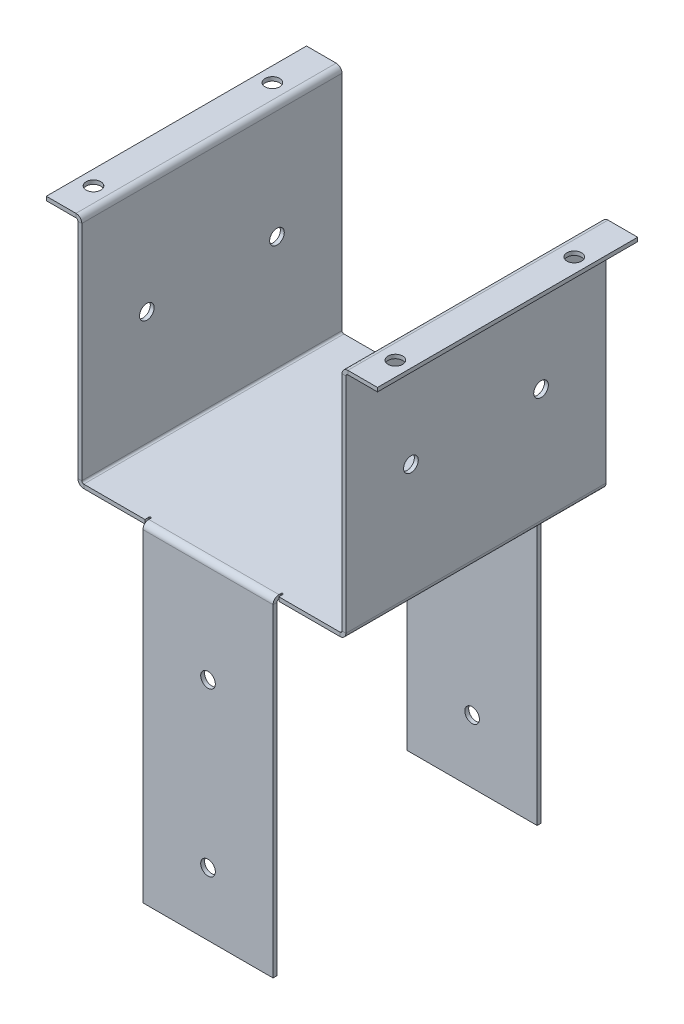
ISO-10303-21;
HEADER;
FILE_DESCRIPTION(('STEP AP214'),'2;1');
FILE_NAME('part.step','',(''),(''),'','','');
FILE_SCHEMA(('AUTOMOTIVE_DESIGN { 1 0 10303 214 1 1 1 1 }'));
ENDSEC;
DATA;
#1=APPLICATION_CONTEXT('core data for automotive mechanical design processes');
#2=APPLICATION_PROTOCOL_DEFINITION('international standard','automotive_design',2000,#1);
#3=PRODUCT_CONTEXT('',#1,'mechanical');
#4=PRODUCT('Part','Part','',(#3));
#5=PRODUCT_RELATED_PRODUCT_CATEGORY('part','',(#4));
#6=PRODUCT_DEFINITION_FORMATION('','',#4);
#7=PRODUCT_DEFINITION_CONTEXT('part definition',#1,'design');
#8=PRODUCT_DEFINITION('design','',#6,#7);
#9=PRODUCT_DEFINITION_SHAPE('','',#8);
#10=(LENGTH_UNIT() NAMED_UNIT(*) SI_UNIT(.MILLI.,.METRE.));
#11=(NAMED_UNIT(*) PLANE_ANGLE_UNIT() SI_UNIT($,.RADIAN.));
#12=(NAMED_UNIT(*) SI_UNIT($,.STERADIAN.) SOLID_ANGLE_UNIT());
#13=UNCERTAINTY_MEASURE_WITH_UNIT(LENGTH_MEASURE(1.E-05),#10,'distance_accuracy_value','');
#14=(GEOMETRIC_REPRESENTATION_CONTEXT(3) GLOBAL_UNCERTAINTY_ASSIGNED_CONTEXT((#13)) GLOBAL_UNIT_ASSIGNED_CONTEXT((#10,
#11,#12)) REPRESENTATION_CONTEXT('',''));
#15=CARTESIAN_POINT('',(0.,0.,0.));
#16=DIRECTION('',(0.,0.,1.));
#17=DIRECTION('',(1.,0.,0.));
#18=AXIS2_PLACEMENT_3D('',#15,#16,#17);
#19=CARTESIAN_POINT('',(-50.038,-1.524,-50.8));
#20=DIRECTION('',(0.,0.,-1.));
#21=DIRECTION('',(-1.,0.,0.));
#22=AXIS2_PLACEMENT_3D('',#19,#20,#21);
#23=PLANE('',#22);
#24=DIRECTION('',(0.,1.,0.));
#25=VECTOR('',#24,1.);
#26=CARTESIAN_POINT('',(-52.324,0.,-50.8));
#27=LINE('',#26,#25);
#28=CARTESIAN_POINT('',(-52.324,0.762,-50.8));
#29=VERTEX_POINT('',#28);
#30=CARTESIAN_POINT('',(-52.3239999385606,87.7714779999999,-50.8));
#31=VERTEX_POINT('',#30);
#32=EDGE_CURVE('E607',#29,#31,#27,.T.);
#33=ORIENTED_EDGE('',*,*,#32,.T.);
#34=DIRECTION('',(1.,0.,0.));
#35=VECTOR('',#34,1.);
#36=CARTESIAN_POINT('',(-50.038,87.771478,-50.8));
#37=LINE('',#36,#35);
#38=CARTESIAN_POINT('',(-50.8,87.771478,-50.8));
#39=VERTEX_POINT('',#38);
#40=EDGE_CURVE('E12',#31,#39,#37,.T.);
#41=ORIENTED_EDGE('',*,*,#40,.T.);
#42=DIRECTION('',(0.,1.,0.));
#43=VECTOR('',#42,1.);
#44=CARTESIAN_POINT('',(-50.8,0.,-50.8));
#45=LINE('',#44,#43);
#46=CARTESIAN_POINT('',(-50.8,0.762,-50.8));
#47=VERTEX_POINT('',#46);
#48=EDGE_CURVE('E571',#47,#39,#45,.T.);
#49=ORIENTED_EDGE('',*,*,#48,.F.);
#50=DIRECTION('',(-1.,0.,0.));
#51=VECTOR('',#50,1.);
#52=CARTESIAN_POINT('',(-50.8,0.762,-50.8));
#53=LINE('',#52,#51);
#54=EDGE_CURVE('E677',#47,#29,#53,.T.);
#55=ORIENTED_EDGE('',*,*,#54,.T.);
#56=EDGE_LOOP('',(#33,#41,#49,#55));
#57=FACE_BOUND('',#56,.T.);
#58=ADVANCED_FACE('F42',(#57),#23,.T.);
#59=CARTESIAN_POINT('',(-52.324,0.,50.8));
#60=DIRECTION('',(-1.,0.,0.));
#61=DIRECTION('',(0.,0.,1.));
#62=AXIS2_PLACEMENT_3D('',#59,#60,#61);
#63=PLANE('',#62);
#64=CARTESIAN_POINT('',(-52.324,45.212,-25.4));
#65=DIRECTION('',(-1.,0.,0.));
#66=DIRECTION('',(0.,0.,1.));
#67=AXIS2_PLACEMENT_3D('',#64,#65,#66);
#68=CIRCLE('',#67,2.85750000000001);
#69=CARTESIAN_POINT('',(-52.324,45.212,-22.5425));
#70=VERTEX_POINT('',#69);
#71=EDGE_CURVE('E767',#70,#70,#68,.T.);
#72=ORIENTED_EDGE('',*,*,#71,.F.);
#73=EDGE_LOOP('',(#72));
#74=FACE_BOUND('',#73,.T.);
#75=CARTESIAN_POINT('',(-52.324,45.212,25.4));
#76=DIRECTION('',(-1.,0.,0.));
#77=DIRECTION('',(0.,0.,1.));
#78=AXIS2_PLACEMENT_3D('',#75,#76,#77);
#79=CIRCLE('',#78,2.85750000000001);
#80=CARTESIAN_POINT('',(-52.324,45.212,28.2575));
#81=VERTEX_POINT('',#80);
#82=EDGE_CURVE('E764',#81,#81,#79,.T.);
#83=ORIENTED_EDGE('',*,*,#82,.F.);
#84=EDGE_LOOP('',(#83));
#85=FACE_BOUND('',#84,.T.);
#86=DIRECTION('',(0.,1.,0.));
#87=VECTOR('',#86,1.);
#88=CARTESIAN_POINT('',(-52.324,0.,50.8));
#89=LINE('',#88,#87);
#90=CARTESIAN_POINT('',(-52.324,0.762,50.8));
#91=VERTEX_POINT('',#90);
#92=CARTESIAN_POINT('',(-52.3239999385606,87.7714779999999,50.8));
#93=VERTEX_POINT('',#92);
#94=EDGE_CURVE('E631',#91,#93,#89,.T.);
#95=ORIENTED_EDGE('',*,*,#94,.T.);
#96=DIRECTION('',(0.,0.,-1.));
#97=VECTOR('',#96,1.);
#98=CARTESIAN_POINT('',(-52.324,87.771478,50.8));
#99=LINE('',#98,#97);
#100=EDGE_CURVE('E730',#93,#31,#99,.T.);
#101=ORIENTED_EDGE('',*,*,#100,.T.);
#102=ORIENTED_EDGE('',*,*,#32,.F.);
#103=DIRECTION('',(0.,0.,-1.));
#104=VECTOR('',#103,1.);
#105=CARTESIAN_POINT('',(-52.324,0.762,50.8));
#106=LINE('',#105,#104);
#107=EDGE_CURVE('E671',#91,#29,#106,.T.);
#108=ORIENTED_EDGE('',*,*,#107,.F.);
#109=EDGE_LOOP('',(#95,#101,#102,#108));
#110=FACE_BOUND('',#109,.T.);
#111=ADVANCED_FACE('F881',(#74,#85,#110),#63,.T.);
#112=CARTESIAN_POINT('',(-50.038,0.762,50.8));
#113=DIRECTION('',(0.,0.,1.));
#114=DIRECTION('',(1.,0.,0.));
#115=AXIS2_PLACEMENT_3D('',#112,#113,#114);
#116=PLANE('',#115);
#117=DIRECTION('',(0.,1.,0.));
#118=VECTOR('',#117,1.);
#119=CARTESIAN_POINT('',(-50.8,0.,50.8));
#120=LINE('',#119,#118);
#121=CARTESIAN_POINT('',(-50.8,0.762,50.8));
#122=VERTEX_POINT('',#121);
#123=CARTESIAN_POINT('',(-50.7999999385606,87.7714779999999,50.8));
#124=VERTEX_POINT('',#123);
#125=EDGE_CURVE('E626',#122,#124,#120,.T.);
#126=ORIENTED_EDGE('',*,*,#125,.T.);
#127=DIRECTION('',(-1.,0.,0.));
#128=VECTOR('',#127,1.);
#129=CARTESIAN_POINT('',(-50.038,87.7714779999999,50.8));
#130=LINE('',#129,#128);
#131=EDGE_CURVE('E737',#124,#93,#130,.T.);
#132=ORIENTED_EDGE('',*,*,#131,.T.);
#133=ORIENTED_EDGE('',*,*,#94,.F.);
#134=DIRECTION('',(1.,0.,0.));
#135=VECTOR('',#134,1.);
#136=CARTESIAN_POINT('',(-52.324,0.762,50.8));
#137=LINE('',#136,#135);
#138=EDGE_CURVE('E679',#91,#122,#137,.T.);
#139=ORIENTED_EDGE('',*,*,#138,.T.);
#140=EDGE_LOOP('',(#126,#132,#133,#139));
#141=FACE_BOUND('',#140,.T.);
#142=ADVANCED_FACE('F886',(#141),#116,.T.);
#143=CARTESIAN_POINT('',(50.038,-1.524,50.8));
#144=DIRECTION('',(0.,0.,1.));
#145=DIRECTION('',(1.,0.,0.));
#146=AXIS2_PLACEMENT_3D('',#143,#144,#145);
#147=PLANE('',#146);
#148=DIRECTION('',(0.,1.,0.));
#149=VECTOR('',#148,1.);
#150=CARTESIAN_POINT('',(52.324,0.,50.8));
#151=LINE('',#150,#149);
#152=CARTESIAN_POINT('',(52.3239999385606,87.7714779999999,50.8));
#153=VERTEX_POINT('',#152);
#154=CARTESIAN_POINT('',(52.324,0.762,50.8));
#155=VERTEX_POINT('',#154);
#156=EDGE_CURVE('E638',#153,#155,#151,.F.);
#157=ORIENTED_EDGE('',*,*,#156,.F.);
#158=DIRECTION('',(-1.,0.,0.));
#159=VECTOR('',#158,1.);
#160=CARTESIAN_POINT('',(50.038,87.771478,50.8));
#161=LINE('',#160,#159);
#162=CARTESIAN_POINT('',(50.8,87.771478,50.8));
#163=VERTEX_POINT('',#162);
#164=EDGE_CURVE('E727',#153,#163,#161,.T.);
#165=ORIENTED_EDGE('',*,*,#164,.T.);
#166=DIRECTION('',(0.,-1.,0.));
#167=VECTOR('',#166,1.);
#168=CARTESIAN_POINT('',(50.8,0.,50.8));
#169=LINE('',#168,#167);
#170=CARTESIAN_POINT('',(50.8,0.762,50.8));
#171=VERTEX_POINT('',#170);
#172=EDGE_CURVE('E643',#163,#171,#169,.T.);
#173=ORIENTED_EDGE('',*,*,#172,.T.);
#174=DIRECTION('',(1.,0.,0.));
#175=VECTOR('',#174,1.);
#176=CARTESIAN_POINT('',(50.8,0.762,50.8));
#177=LINE('',#176,#175);
#178=EDGE_CURVE('E691',#171,#155,#177,.T.);
#179=ORIENTED_EDGE('',*,*,#178,.T.);
#180=EDGE_LOOP('',(#157,#165,#173,#179));
#181=FACE_BOUND('',#180,.T.);
#182=ADVANCED_FACE('F1152',(#181),#147,.T.);
#183=CARTESIAN_POINT('',(52.324,0.,50.8));
#184=DIRECTION('',(1.,0.,0.));
#185=DIRECTION('',(0.,0.,-1.));
#186=AXIS2_PLACEMENT_3D('',#183,#184,#185);
#187=PLANE('',#186);
#188=CARTESIAN_POINT('',(52.324,45.212,-25.4));
#189=DIRECTION('',(1.,0.,0.));
#190=DIRECTION('',(0.,0.,-1.));
#191=AXIS2_PLACEMENT_3D('',#188,#189,#190);
#192=CIRCLE('',#191,2.85750000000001);
#193=CARTESIAN_POINT('',(52.324,45.212,-28.2575));
#194=VERTEX_POINT('',#193);
#195=EDGE_CURVE('E1916',#194,#194,#192,.T.);
#196=ORIENTED_EDGE('',*,*,#195,.F.);
#197=EDGE_LOOP('',(#196));
#198=FACE_BOUND('',#197,.T.);
#199=CARTESIAN_POINT('',(52.324,45.212,25.4));
#200=DIRECTION('',(1.,0.,0.));
#201=DIRECTION('',(0.,0.,-1.));
#202=AXIS2_PLACEMENT_3D('',#199,#200,#201);
#203=CIRCLE('',#202,2.85750000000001);
#204=CARTESIAN_POINT('',(52.324,45.212,22.5425));
#205=VERTEX_POINT('',#204);
#206=EDGE_CURVE('E760',#205,#205,#203,.T.);
#207=ORIENTED_EDGE('',*,*,#206,.F.);
#208=EDGE_LOOP('',(#207));
#209=FACE_BOUND('',#208,.T.);
#210=DIRECTION('',(0.,1.,0.));
#211=VECTOR('',#210,1.);
#212=CARTESIAN_POINT('',(52.324,0.,-50.8));
#213=LINE('',#212,#211);
#214=CARTESIAN_POINT('',(52.3239999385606,87.7714779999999,-50.8));
#215=VERTEX_POINT('',#214);
#216=CARTESIAN_POINT('',(52.324,0.762,-50.8));
#217=VERTEX_POINT('',#216);
#218=EDGE_CURVE('E614',#215,#217,#213,.F.);
#219=ORIENTED_EDGE('',*,*,#218,.F.);
#220=DIRECTION('',(0.,0.,1.));
#221=VECTOR('',#220,1.);
#222=CARTESIAN_POINT('',(52.324,87.771478,50.8));
#223=LINE('',#222,#221);
#224=EDGE_CURVE('E720',#215,#153,#223,.T.);
#225=ORIENTED_EDGE('',*,*,#224,.T.);
#226=ORIENTED_EDGE('',*,*,#156,.T.);
#227=DIRECTION('',(0.,0.,-1.));
#228=VECTOR('',#227,1.);
#229=CARTESIAN_POINT('',(52.324,0.762,50.8));
#230=LINE('',#229,#228);
#231=EDGE_CURVE('E662',#155,#217,#230,.T.);
#232=ORIENTED_EDGE('',*,*,#231,.T.);
#233=EDGE_LOOP('',(#219,#225,#226,#232));
#234=FACE_BOUND('',#233,.T.);
#235=ADVANCED_FACE('F1147',(#198,#209,#234),#187,.T.);
#236=CARTESIAN_POINT('',(-50.8,-1.524,50.8));
#237=DIRECTION('',(0.,-1.,0.));
#238=DIRECTION('',(0.,0.,-1.));
#239=AXIS2_PLACEMENT_3D('',#236,#237,#238);
#240=PLANE('',#239);
#241=CARTESIAN_POINT('',(25.781,-1.524,-49.276));
#242=DIRECTION('',(0.,-1.,0.));
#243=DIRECTION('',(0.,0.,-1.));
#244=AXIS2_PLACEMENT_3D('',#241,#242,#243);
#245=CIRCLE('',#244,0.380999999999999);
#246=CARTESIAN_POINT('',(26.162,-1.524,-49.276));
#247=VERTEX_POINT('',#246);
#248=CARTESIAN_POINT('',(25.4,-1.524,-49.276));
#249=VERTEX_POINT('',#248);
#250=EDGE_CURVE('E482',#247,#249,#245,.T.);
#251=ORIENTED_EDGE('',*,*,#250,.F.);
#252=DIRECTION('',(0.,0.,1.));
#253=VECTOR('',#252,1.);
#254=CARTESIAN_POINT('',(26.162,-1.524,-50.8));
#255=LINE('',#254,#253);
#256=CARTESIAN_POINT('',(26.162,-1.524,-50.8));
#257=VERTEX_POINT('',#256);
#258=EDGE_CURVE('E477',#257,#247,#255,.T.);
#259=ORIENTED_EDGE('',*,*,#258,.F.);
#260=DIRECTION('',(1.,0.,0.));
#261=VECTOR('',#260,1.);
#262=CARTESIAN_POINT('',(-50.8,-1.524,-50.8));
#263=LINE('',#262,#261);
#264=CARTESIAN_POINT('',(50.038,-1.524,-50.8));
#265=VERTEX_POINT('',#264);
#266=EDGE_CURVE('E608',#265,#257,#263,.F.);
#267=ORIENTED_EDGE('',*,*,#266,.F.);
#268=DIRECTION('',(0.,0.,-1.));
#269=VECTOR('',#268,1.);
#270=CARTESIAN_POINT('',(50.038,-1.524,50.8));
#271=LINE('',#270,#269);
#272=CARTESIAN_POINT('',(50.038,-1.524,50.8));
#273=VERTEX_POINT('',#272);
#274=EDGE_CURVE('E665',#273,#265,#271,.T.);
#275=ORIENTED_EDGE('',*,*,#274,.F.);
#276=DIRECTION('',(1.,0.,0.));
#277=VECTOR('',#276,1.);
#278=CARTESIAN_POINT('',(-50.8,-1.524,50.8));
#279=LINE('',#278,#277);
#280=CARTESIAN_POINT('',(26.162,-1.524,50.8));
#281=VERTEX_POINT('',#280);
#282=EDGE_CURVE('E632',#273,#281,#279,.F.);
#283=ORIENTED_EDGE('',*,*,#282,.T.);
#284=DIRECTION('',(0.,0.,1.));
#285=VECTOR('',#284,1.);
#286=CARTESIAN_POINT('',(26.162,-1.524,49.276));
#287=LINE('',#286,#285);
#288=CARTESIAN_POINT('',(26.162,-1.524,49.276));
#289=VERTEX_POINT('',#288);
#290=EDGE_CURVE('E588',#289,#281,#287,.T.);
#291=ORIENTED_EDGE('',*,*,#290,.F.);
#292=CARTESIAN_POINT('',(25.781,-1.524,49.276));
#293=DIRECTION('',(0.,-1.,0.));
#294=DIRECTION('',(0.,0.,-1.));
#295=AXIS2_PLACEMENT_3D('',#292,#293,#294);
#296=CIRCLE('',#295,0.380999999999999);
#297=CARTESIAN_POINT('',(25.4,-1.524,49.276));
#298=VERTEX_POINT('',#297);
#299=EDGE_CURVE('E584',#298,#289,#296,.T.);
#300=ORIENTED_EDGE('',*,*,#299,.F.);
#301=DIRECTION('',(0.,0.,-1.));
#302=VECTOR('',#301,1.);
#303=CARTESIAN_POINT('',(25.4,-1.524,50.038));
#304=LINE('',#303,#302);
#305=CARTESIAN_POINT('',(25.4,-1.524,50.038));
#306=VERTEX_POINT('',#305);
#307=EDGE_CURVE('E581',#306,#298,#304,.T.);
#308=ORIENTED_EDGE('',*,*,#307,.F.);
#309=DIRECTION('',(-1.,0.,0.));
#310=VECTOR('',#309,1.);
#311=CARTESIAN_POINT('',(-25.4,-1.524,50.038));
#312=LINE('',#311,#310);
#313=CARTESIAN_POINT('',(-25.4,-1.524,50.038));
#314=VERTEX_POINT('',#313);
#315=EDGE_CURVE('E550',#314,#306,#312,.F.);
#316=ORIENTED_EDGE('',*,*,#315,.F.);
#317=DIRECTION('',(0.,0.,1.));
#318=VECTOR('',#317,1.);
#319=CARTESIAN_POINT('',(-25.4,-1.524,49.276));
#320=LINE('',#319,#318);
#321=CARTESIAN_POINT('',(-25.4,-1.524,49.276));
#322=VERTEX_POINT('',#321);
#323=EDGE_CURVE('E577',#322,#314,#320,.T.);
#324=ORIENTED_EDGE('',*,*,#323,.F.);
#325=CARTESIAN_POINT('',(-25.781,-1.524,49.276));
#326=DIRECTION('',(0.,-1.,0.));
#327=DIRECTION('',(0.,0.,-1.));
#328=AXIS2_PLACEMENT_3D('',#325,#326,#327);
#329=CIRCLE('',#328,0.380999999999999);
#330=CARTESIAN_POINT('',(-26.162,-1.524,49.276));
#331=VERTEX_POINT('',#330);
#332=EDGE_CURVE('E573',#331,#322,#329,.T.);
#333=ORIENTED_EDGE('',*,*,#332,.F.);
#334=DIRECTION('',(0.,0.,-1.));
#335=VECTOR('',#334,1.);
#336=CARTESIAN_POINT('',(-26.162,-1.524,50.8));
#337=LINE('',#336,#335);
#338=CARTESIAN_POINT('',(-26.162,-1.524,50.8));
#339=VERTEX_POINT('',#338);
#340=EDGE_CURVE('E568',#339,#331,#337,.T.);
#341=ORIENTED_EDGE('',*,*,#340,.F.);
#342=CARTESIAN_POINT('',(-50.038,-1.524,50.8));
#343=VERTEX_POINT('',#342);
#344=EDGE_CURVE('E630',#339,#343,#279,.F.);
#345=ORIENTED_EDGE('',*,*,#344,.T.);
#346=DIRECTION('',(0.,0.,-1.));
#347=VECTOR('',#346,1.);
#348=CARTESIAN_POINT('',(-50.038,-1.524,50.8));
#349=LINE('',#348,#347);
#350=CARTESIAN_POINT('',(-50.038,-1.524,-50.8));
#351=VERTEX_POINT('',#350);
#352=EDGE_CURVE('E668',#343,#351,#349,.T.);
#353=ORIENTED_EDGE('',*,*,#352,.T.);
#354=CARTESIAN_POINT('',(-26.162,-1.524,-50.8));
#355=VERTEX_POINT('',#354);
#356=EDGE_CURVE('E606',#355,#351,#263,.F.);
#357=ORIENTED_EDGE('',*,*,#356,.F.);
#358=DIRECTION('',(0.,0.,-1.));
#359=VECTOR('',#358,1.);
#360=CARTESIAN_POINT('',(-26.162,-1.52399999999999,-49.276));
#361=LINE('',#360,#359);
#362=CARTESIAN_POINT('',(-26.162,-1.52399999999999,-49.276));
#363=VERTEX_POINT('',#362);
#364=EDGE_CURVE('E496',#363,#355,#361,.T.);
#365=ORIENTED_EDGE('',*,*,#364,.F.);
#366=CARTESIAN_POINT('',(-25.781,-1.52399999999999,-49.276));
#367=DIRECTION('',(0.,-1.,0.));
#368=DIRECTION('',(0.,0.,-1.));
#369=AXIS2_PLACEMENT_3D('',#366,#367,#368);
#370=CIRCLE('',#369,0.380999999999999);
#371=CARTESIAN_POINT('',(-25.4,-1.52399999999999,-49.276));
#372=VERTEX_POINT('',#371);
#373=EDGE_CURVE('E492',#372,#363,#370,.T.);
#374=ORIENTED_EDGE('',*,*,#373,.F.);
#375=DIRECTION('',(0.,0.,1.));
#376=VECTOR('',#375,1.);
#377=CARTESIAN_POINT('',(-25.4,-1.52399999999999,-50.038));
#378=LINE('',#377,#376);
#379=CARTESIAN_POINT('',(-25.4,-1.52399999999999,-50.038));
#380=VERTEX_POINT('',#379);
#381=EDGE_CURVE('E489',#380,#372,#378,.T.);
#382=ORIENTED_EDGE('',*,*,#381,.F.);
#383=DIRECTION('',(1.,0.,0.));
#384=VECTOR('',#383,1.);
#385=CARTESIAN_POINT('',(25.4,-1.524,-50.038));
#386=LINE('',#385,#384);
#387=CARTESIAN_POINT('',(25.4,-1.524,-50.038));
#388=VERTEX_POINT('',#387);
#389=EDGE_CURVE('E457',#388,#380,#386,.F.);
#390=ORIENTED_EDGE('',*,*,#389,.F.);
#391=DIRECTION('',(0.,0.,-1.));
#392=VECTOR('',#391,1.);
#393=CARTESIAN_POINT('',(25.4,-1.524,-49.276));
#394=LINE('',#393,#392);
#395=EDGE_CURVE('E486',#249,#388,#394,.T.);
#396=ORIENTED_EDGE('',*,*,#395,.F.);
#397=EDGE_LOOP('',(#251,#259,#267,#275,#283,#291,#300,#308,#316,#324,#333,#341,#345,#353,#357,
#365,#374,#382,#390,#396));
#398=FACE_BOUND('',#397,.T.);
#399=ADVANCED_FACE('F865',(#398),#240,.T.);
#400=CARTESIAN_POINT('',(-50.8,0.,50.8));
#401=DIRECTION('',(0.,-1.,0.));
#402=DIRECTION('',(0.,0.,-1.));
#403=AXIS2_PLACEMENT_3D('',#400,#401,#402);
#404=PLANE('',#403);
#405=DIRECTION('',(0.,0.,-1.));
#406=VECTOR('',#405,1.);
#407=CARTESIAN_POINT('',(26.1620000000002,0.,50.7999999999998));
#408=LINE('',#407,#406);
#409=CARTESIAN_POINT('',(26.162,0.,-49.276));
#410=VERTEX_POINT('',#409);
#411=CARTESIAN_POINT('',(26.162,0.,-50.8));
#412=VERTEX_POINT('',#411);
#413=EDGE_CURVE('E511',#410,#412,#408,.T.);
#414=ORIENTED_EDGE('',*,*,#413,.F.);
#415=CARTESIAN_POINT('',(25.781,0.,-49.276));
#416=DIRECTION('',(0.,-1.,0.));
#417=DIRECTION('',(0.,0.,-1.));
#418=AXIS2_PLACEMENT_3D('',#415,#416,#417);
#419=CIRCLE('',#418,0.380999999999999);
#420=CARTESIAN_POINT('',(25.4,0.,-49.276));
#421=VERTEX_POINT('',#420);
#422=EDGE_CURVE('E718',#421,#410,#419,.F.);
#423=ORIENTED_EDGE('',*,*,#422,.F.);
#424=DIRECTION('',(0.,0.,1.));
#425=VECTOR('',#424,1.);
#426=CARTESIAN_POINT('',(25.4,0.,50.8));
#427=LINE('',#426,#425);
#428=CARTESIAN_POINT('',(25.4,0.,-50.038));
#429=VERTEX_POINT('',#428);
#430=EDGE_CURVE('E716',#429,#421,#427,.T.);
#431=ORIENTED_EDGE('',*,*,#430,.F.);
#432=DIRECTION('',(1.,0.,0.));
#433=VECTOR('',#432,1.);
#434=CARTESIAN_POINT('',(25.4,0.,-50.038));
#435=LINE('',#434,#433);
#436=CARTESIAN_POINT('',(-25.4,0.,-50.038));
#437=VERTEX_POINT('',#436);
#438=EDGE_CURVE('E462',#429,#437,#435,.F.);
#439=ORIENTED_EDGE('',*,*,#438,.T.);
#440=DIRECTION('',(0.,0.,-1.));
#441=VECTOR('',#440,1.);
#442=CARTESIAN_POINT('',(-25.4,0.,50.8));
#443=LINE('',#442,#441);
#444=CARTESIAN_POINT('',(-25.4,0.,-49.276));
#445=VERTEX_POINT('',#444);
#446=EDGE_CURVE('E714',#445,#437,#443,.T.);
#447=ORIENTED_EDGE('',*,*,#446,.F.);
#448=CARTESIAN_POINT('',(-25.781,0.,-49.276));
#449=DIRECTION('',(0.,-1.,0.));
#450=DIRECTION('',(0.,0.,-1.));
#451=AXIS2_PLACEMENT_3D('',#448,#449,#450);
#452=CIRCLE('',#451,0.380999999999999);
#453=CARTESIAN_POINT('',(-26.162,0.,-49.276));
#454=VERTEX_POINT('',#453);
#455=EDGE_CURVE('E712',#454,#445,#452,.F.);
#456=ORIENTED_EDGE('',*,*,#455,.F.);
#457=DIRECTION('',(0.,0.,1.));
#458=VECTOR('',#457,1.);
#459=CARTESIAN_POINT('',(-26.162,0.,50.8));
#460=LINE('',#459,#458);
#461=CARTESIAN_POINT('',(-26.162,0.,-50.8));
#462=VERTEX_POINT('',#461);
#463=EDGE_CURVE('E480',#462,#454,#460,.T.);
#464=ORIENTED_EDGE('',*,*,#463,.F.);
#465=DIRECTION('',(-1.,0.,0.));
#466=VECTOR('',#465,1.);
#467=CARTESIAN_POINT('',(-50.8,0.,-50.8));
#468=LINE('',#467,#466);
#469=CARTESIAN_POINT('',(-50.038,0.,-50.8));
#470=VERTEX_POINT('',#469);
#471=EDGE_CURVE('E618',#462,#470,#468,.T.);
#472=ORIENTED_EDGE('',*,*,#471,.T.);
#473=DIRECTION('',(0.,0.,-1.));
#474=VECTOR('',#473,1.);
#475=CARTESIAN_POINT('',(-50.038,0.,50.8));
#476=LINE('',#475,#474);
#477=CARTESIAN_POINT('',(-50.038,0.,50.8));
#478=VERTEX_POINT('',#477);
#479=EDGE_CURVE('E653',#478,#470,#476,.T.);
#480=ORIENTED_EDGE('',*,*,#479,.F.);
#481=DIRECTION('',(-1.,0.,0.));
#482=VECTOR('',#481,1.);
#483=CARTESIAN_POINT('',(-50.8,0.,50.8));
#484=LINE('',#483,#482);
#485=CARTESIAN_POINT('',(-26.162,0.,50.8));
#486=VERTEX_POINT('',#485);
#487=EDGE_CURVE('E642',#486,#478,#484,.T.);
#488=ORIENTED_EDGE('',*,*,#487,.F.);
#489=DIRECTION('',(0.,0.,1.));
#490=VECTOR('',#489,1.);
#491=CARTESIAN_POINT('',(-26.162,0.,50.8));
#492=LINE('',#491,#490);
#493=CARTESIAN_POINT('',(-26.162,0.,49.276));
#494=VERTEX_POINT('',#493);
#495=EDGE_CURVE('E709',#494,#486,#492,.T.);
#496=ORIENTED_EDGE('',*,*,#495,.F.);
#497=CARTESIAN_POINT('',(-25.781,0.,49.276));
#498=DIRECTION('',(0.,-1.,0.));
#499=DIRECTION('',(0.,0.,-1.));
#500=AXIS2_PLACEMENT_3D('',#497,#498,#499);
#501=CIRCLE('',#500,0.380999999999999);
#502=CARTESIAN_POINT('',(-25.4,0.,49.276));
#503=VERTEX_POINT('',#502);
#504=EDGE_CURVE('E706',#503,#494,#501,.F.);
#505=ORIENTED_EDGE('',*,*,#504,.F.);
#506=DIRECTION('',(0.,0.,-1.));
#507=VECTOR('',#506,1.);
#508=CARTESIAN_POINT('',(-25.4,0.,50.8));
#509=LINE('',#508,#507);
#510=CARTESIAN_POINT('',(-25.4,0.,50.038));
#511=VERTEX_POINT('',#510);
#512=EDGE_CURVE('E703',#511,#503,#509,.T.);
#513=ORIENTED_EDGE('',*,*,#512,.F.);
#514=DIRECTION('',(-1.,0.,0.));
#515=VECTOR('',#514,1.);
#516=CARTESIAN_POINT('',(-25.4,0.,50.038));
#517=LINE('',#516,#515);
#518=CARTESIAN_POINT('',(25.4,0.,50.038));
#519=VERTEX_POINT('',#518);
#520=EDGE_CURVE('E555',#511,#519,#517,.F.);
#521=ORIENTED_EDGE('',*,*,#520,.T.);
#522=DIRECTION('',(0.,0.,1.));
#523=VECTOR('',#522,1.);
#524=CARTESIAN_POINT('',(25.4,0.,50.8));
#525=LINE('',#524,#523);
#526=CARTESIAN_POINT('',(25.4,0.,49.276));
#527=VERTEX_POINT('',#526);
#528=EDGE_CURVE('E700',#527,#519,#525,.T.);
#529=ORIENTED_EDGE('',*,*,#528,.F.);
#530=CARTESIAN_POINT('',(25.781,0.,49.276));
#531=DIRECTION('',(0.,-1.,0.));
#532=DIRECTION('',(0.,0.,-1.));
#533=AXIS2_PLACEMENT_3D('',#530,#531,#532);
#534=CIRCLE('',#533,0.380999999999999);
#535=CARTESIAN_POINT('',(26.162,0.,49.276));
#536=VERTEX_POINT('',#535);
#537=EDGE_CURVE('E697',#536,#527,#534,.F.);
#538=ORIENTED_EDGE('',*,*,#537,.F.);
#539=DIRECTION('',(0.,0.,-1.));
#540=VECTOR('',#539,1.);
#541=CARTESIAN_POINT('',(26.162,0.,50.8000000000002));
#542=LINE('',#541,#540);
#543=CARTESIAN_POINT('',(26.162,0.,50.8));
#544=VERTEX_POINT('',#543);
#545=EDGE_CURVE('E694',#544,#536,#542,.T.);
#546=ORIENTED_EDGE('',*,*,#545,.F.);
#547=CARTESIAN_POINT('',(50.038,0.,50.8));
#548=VERTEX_POINT('',#547);
#549=EDGE_CURVE('E644',#548,#544,#484,.T.);
#550=ORIENTED_EDGE('',*,*,#549,.F.);
#551=DIRECTION('',(0.,0.,-1.));
#552=VECTOR('',#551,1.);
#553=CARTESIAN_POINT('',(50.038,0.,50.8));
#554=LINE('',#553,#552);
#555=CARTESIAN_POINT('',(50.038,0.,-50.8));
#556=VERTEX_POINT('',#555);
#557=EDGE_CURVE('E656',#548,#556,#554,.T.);
#558=ORIENTED_EDGE('',*,*,#557,.T.);
#559=EDGE_CURVE('E620',#556,#412,#468,.T.);
#560=ORIENTED_EDGE('',*,*,#559,.T.);
#561=EDGE_LOOP('',(#414,#423,#431,#439,#447,#456,#464,#472,#480,#488,#496,#505,#513,#521,#529,
#538,#546,#550,#558,#560));
#562=FACE_BOUND('',#561,.T.);
#563=ADVANCED_FACE('F1456',(#562),#404,.F.);
#564=CARTESIAN_POINT('',(52.324,0.762,-50.8));
#565=DIRECTION('',(0.,0.,-1.));
#566=DIRECTION('',(-1.,0.,0.));
#567=AXIS2_PLACEMENT_3D('',#564,#565,#566);
#568=PLANE('',#567);
#569=ORIENTED_EDGE('',*,*,#266,.T.);
#570=DIRECTION('',(0.,1.,0.));
#571=VECTOR('',#570,1.);
#572=CARTESIAN_POINT('',(26.162,-1.524,-50.8));
#573=LINE('',#572,#571);
#574=EDGE_CURVE('E481',#257,#412,#573,.T.);
#575=ORIENTED_EDGE('',*,*,#574,.T.);
#576=ORIENTED_EDGE('',*,*,#559,.F.);
#577=DIRECTION('',(0.,-1.,0.));
#578=VECTOR('',#577,1.);
#579=CARTESIAN_POINT('',(50.038,0.,-50.8));
#580=LINE('',#579,#578);
#581=EDGE_CURVE('E687',#556,#265,#580,.T.);
#582=ORIENTED_EDGE('',*,*,#581,.T.);
#583=EDGE_LOOP('',(#569,#575,#576,#582));
#584=FACE_BOUND('',#583,.T.);
#585=ADVANCED_FACE('F1465',(#584),#568,.T.);
#586=ORIENTED_EDGE('',*,*,#471,.F.);
#587=DIRECTION('',(0.,1.,0.));
#588=VECTOR('',#587,1.);
#589=CARTESIAN_POINT('',(-26.162,-1.52399999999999,-50.8));
#590=LINE('',#589,#588);
#591=EDGE_CURVE('E498',#355,#462,#590,.T.);
#592=ORIENTED_EDGE('',*,*,#591,.F.);
#593=ORIENTED_EDGE('',*,*,#356,.T.);
#594=DIRECTION('',(0.,1.,0.));
#595=VECTOR('',#594,1.);
#596=CARTESIAN_POINT('',(-50.038,-1.524,-50.8));
#597=LINE('',#596,#595);
#598=EDGE_CURVE('E674',#351,#470,#597,.T.);
#599=ORIENTED_EDGE('',*,*,#598,.T.);
#600=EDGE_LOOP('',(#586,#592,#593,#599));
#601=FACE_BOUND('',#600,.T.);
#602=ADVANCED_FACE('F1476',(#601),#568,.T.);
#603=CARTESIAN_POINT('',(-52.324,0.762,50.8));
#604=DIRECTION('',(0.,0.,1.));
#605=DIRECTION('',(1.,0.,0.));
#606=AXIS2_PLACEMENT_3D('',#603,#604,#605);
#607=PLANE('',#606);
#608=ORIENTED_EDGE('',*,*,#344,.F.);
#609=DIRECTION('',(0.,1.,0.));
#610=VECTOR('',#609,1.);
#611=CARTESIAN_POINT('',(-26.162,-1.524,50.8));
#612=LINE('',#611,#610);
#613=EDGE_CURVE('E572',#339,#486,#612,.T.);
#614=ORIENTED_EDGE('',*,*,#613,.T.);
#615=ORIENTED_EDGE('',*,*,#487,.T.);
#616=DIRECTION('',(0.,-1.,0.));
#617=VECTOR('',#616,1.);
#618=CARTESIAN_POINT('',(-50.038,0.,50.8));
#619=LINE('',#618,#617);
#620=EDGE_CURVE('E681',#478,#343,#619,.T.);
#621=ORIENTED_EDGE('',*,*,#620,.T.);
#622=EDGE_LOOP('',(#608,#614,#615,#621));
#623=FACE_BOUND('',#622,.T.);
#624=ADVANCED_FACE('F1487',(#623),#607,.T.);
#625=ORIENTED_EDGE('',*,*,#549,.T.);
#626=DIRECTION('',(0.,1.,0.));
#627=VECTOR('',#626,1.);
#628=CARTESIAN_POINT('',(26.162,-1.524,50.8));
#629=LINE('',#628,#627);
#630=EDGE_CURVE('E591',#281,#544,#629,.T.);
#631=ORIENTED_EDGE('',*,*,#630,.F.);
#632=ORIENTED_EDGE('',*,*,#282,.F.);
#633=DIRECTION('',(0.,1.,0.));
#634=VECTOR('',#633,1.);
#635=CARTESIAN_POINT('',(50.038,-1.524,50.8));
#636=LINE('',#635,#634);
#637=EDGE_CURVE('E689',#273,#548,#636,.T.);
#638=ORIENTED_EDGE('',*,*,#637,.T.);
#639=EDGE_LOOP('',(#625,#631,#632,#638));
#640=FACE_BOUND('',#639,.T.);
#641=ADVANCED_FACE('F1646',(#640),#607,.T.);
#642=CARTESIAN_POINT('',(50.8,0.762,50.8));
#643=DIRECTION('',(0.,0.,1.));
#644=DIRECTION('',(1.,0.,0.));
#645=AXIS2_PLACEMENT_3D('',#642,#643,#644);
#646=PLANE('',#645);
#647=ORIENTED_EDGE('',*,*,#178,.F.);
#648=CARTESIAN_POINT('',(50.038,0.762,50.8));
#649=DIRECTION('',(0.,0.,1.));
#650=DIRECTION('',(1.,0.,0.));
#651=AXIS2_PLACEMENT_3D('',#648,#649,#650);
#652=CIRCLE('',#651,0.762);
#653=EDGE_CURVE('E639',#171,#548,#652,.F.);
#654=ORIENTED_EDGE('',*,*,#653,.T.);
#655=ORIENTED_EDGE('',*,*,#637,.F.);
#656=CARTESIAN_POINT('',(50.038,0.762,50.8));
#657=DIRECTION('',(0.,0.,1.));
#658=DIRECTION('',(1.,0.,0.));
#659=AXIS2_PLACEMENT_3D('',#656,#657,#658);
#660=CIRCLE('',#659,2.286);
#661=EDGE_CURVE('E635',#155,#273,#660,.F.);
#662=ORIENTED_EDGE('',*,*,#661,.F.);
#663=EDGE_LOOP('',(#647,#654,#655,#662));
#664=FACE_BOUND('',#663,.T.);
#665=ADVANCED_FACE('F1658',(#664),#646,.T.);
#666=CARTESIAN_POINT('',(50.038,0.,-50.8));
#667=DIRECTION('',(0.,0.,-1.));
#668=DIRECTION('',(-1.,0.,0.));
#669=AXIS2_PLACEMENT_3D('',#666,#667,#668);
#670=PLANE('',#669);
#671=ORIENTED_EDGE('',*,*,#581,.F.);
#672=CARTESIAN_POINT('',(50.038,0.762,-50.8));
#673=DIRECTION('',(0.,0.,1.));
#674=DIRECTION('',(1.,0.,0.));
#675=AXIS2_PLACEMENT_3D('',#672,#673,#674);
#676=CIRCLE('',#675,0.762);
#677=CARTESIAN_POINT('',(50.8,0.762,-50.8));
#678=VERTEX_POINT('',#677);
#679=EDGE_CURVE('E615',#678,#556,#676,.F.);
#680=ORIENTED_EDGE('',*,*,#679,.F.);
#681=DIRECTION('',(-1.,0.,0.));
#682=VECTOR('',#681,1.);
#683=CARTESIAN_POINT('',(52.324,0.762,-50.8));
#684=LINE('',#683,#682);
#685=EDGE_CURVE('E684',#217,#678,#684,.T.);
#686=ORIENTED_EDGE('',*,*,#685,.F.);
#687=CARTESIAN_POINT('',(50.038,0.762,-50.8));
#688=DIRECTION('',(0.,0.,1.));
#689=DIRECTION('',(1.,0.,0.));
#690=AXIS2_PLACEMENT_3D('',#687,#688,#689);
#691=CIRCLE('',#690,2.286);
#692=EDGE_CURVE('E611',#217,#265,#691,.F.);
#693=ORIENTED_EDGE('',*,*,#692,.T.);
#694=EDGE_LOOP('',(#671,#680,#686,#693));
#695=FACE_BOUND('',#694,.T.);
#696=ADVANCED_FACE('F1668',(#695),#670,.T.);
#697=CARTESIAN_POINT('',(-50.038,0.,50.8));
#698=DIRECTION('',(0.,0.,1.));
#699=DIRECTION('',(1.,0.,0.));
#700=AXIS2_PLACEMENT_3D('',#697,#698,#699);
#701=PLANE('',#700);
#702=ORIENTED_EDGE('',*,*,#620,.F.);
#703=CARTESIAN_POINT('',(-50.038,0.762,50.8));
#704=DIRECTION('',(0.,0.,1.));
#705=DIRECTION('',(1.,0.,0.));
#706=AXIS2_PLACEMENT_3D('',#703,#704,#705);
#707=CIRCLE('',#706,0.762);
#708=EDGE_CURVE('E647',#478,#122,#707,.F.);
#709=ORIENTED_EDGE('',*,*,#708,.T.);
#710=ORIENTED_EDGE('',*,*,#138,.F.);
#711=CARTESIAN_POINT('',(-50.038,0.762,50.8));
#712=DIRECTION('',(0.,0.,1.));
#713=DIRECTION('',(1.,0.,0.));
#714=AXIS2_PLACEMENT_3D('',#711,#712,#713);
#715=CIRCLE('',#714,2.286);
#716=EDGE_CURVE('E627',#343,#91,#715,.F.);
#717=ORIENTED_EDGE('',*,*,#716,.F.);
#718=EDGE_LOOP('',(#702,#709,#710,#717));
#719=FACE_BOUND('',#718,.T.);
#720=ADVANCED_FACE('F905',(#719),#701,.T.);
#721=CARTESIAN_POINT('',(-50.8,0.762,-50.8));
#722=DIRECTION('',(0.,0.,-1.));
#723=DIRECTION('',(-1.,0.,0.));
#724=AXIS2_PLACEMENT_3D('',#721,#722,#723);
#725=PLANE('',#724);
#726=ORIENTED_EDGE('',*,*,#54,.F.);
#727=CARTESIAN_POINT('',(-50.038,0.762,-50.8));
#728=DIRECTION('',(0.,0.,1.));
#729=DIRECTION('',(1.,0.,0.));
#730=AXIS2_PLACEMENT_3D('',#727,#728,#729);
#731=CIRCLE('',#730,0.762);
#732=EDGE_CURVE('E623',#470,#47,#731,.F.);
#733=ORIENTED_EDGE('',*,*,#732,.F.);
#734=ORIENTED_EDGE('',*,*,#598,.F.);
#735=CARTESIAN_POINT('',(-50.038,0.762,-50.8));
#736=DIRECTION('',(0.,0.,1.));
#737=DIRECTION('',(1.,0.,0.));
#738=AXIS2_PLACEMENT_3D('',#735,#736,#737);
#739=CIRCLE('',#738,2.286);
#740=EDGE_CURVE('E603',#351,#29,#739,.F.);
#741=ORIENTED_EDGE('',*,*,#740,.T.);
#742=EDGE_LOOP('',(#726,#733,#734,#741));
#743=FACE_BOUND('',#742,.T.);
#744=ADVANCED_FACE('F897',(#743),#725,.T.);
#745=CARTESIAN_POINT('',(-50.8,0.,50.8));
#746=DIRECTION('',(-1.,0.,0.));
#747=DIRECTION('',(0.,0.,1.));
#748=AXIS2_PLACEMENT_3D('',#745,#746,#747);
#749=PLANE('',#748);
#750=CARTESIAN_POINT('',(-50.8,45.212,-25.4));
#751=DIRECTION('',(-1.,0.,0.));
#752=DIRECTION('',(0.,0.,1.));
#753=AXIS2_PLACEMENT_3D('',#750,#751,#752);
#754=CIRCLE('',#753,2.85750000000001);
#755=CARTESIAN_POINT('',(-50.8,45.212,-22.5425));
#756=VERTEX_POINT('',#755);
#757=EDGE_CURVE('E772',#756,#756,#754,.T.);
#758=ORIENTED_EDGE('',*,*,#757,.T.);
#759=EDGE_LOOP('',(#758));
#760=FACE_BOUND('',#759,.T.);
#761=CARTESIAN_POINT('',(-50.8,45.212,25.4));
#762=DIRECTION('',(-1.,0.,0.));
#763=DIRECTION('',(0.,0.,1.));
#764=AXIS2_PLACEMENT_3D('',#761,#762,#763);
#765=CIRCLE('',#764,2.85750000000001);
#766=CARTESIAN_POINT('',(-50.8,45.212,28.2575));
#767=VERTEX_POINT('',#766);
#768=EDGE_CURVE('E759',#767,#767,#765,.T.);
#769=ORIENTED_EDGE('',*,*,#768,.T.);
#770=EDGE_LOOP('',(#769));
#771=FACE_BOUND('',#770,.T.);
#772=DIRECTION('',(0.,0.,-1.));
#773=VECTOR('',#772,1.);
#774=CARTESIAN_POINT('',(-50.8,87.771478,50.8));
#775=LINE('',#774,#773);
#776=EDGE_CURVE('E50',#124,#39,#775,.T.);
#777=ORIENTED_EDGE('',*,*,#776,.F.);
#778=ORIENTED_EDGE('',*,*,#125,.F.);
#779=DIRECTION('',(0.,0.,-1.));
#780=VECTOR('',#779,1.);
#781=CARTESIAN_POINT('',(-50.8,0.762,50.8));
#782=LINE('',#781,#780);
#783=EDGE_CURVE('E650',#122,#47,#782,.T.);
#784=ORIENTED_EDGE('',*,*,#783,.T.);
#785=ORIENTED_EDGE('',*,*,#48,.T.);
#786=EDGE_LOOP('',(#777,#778,#784,#785));
#787=FACE_BOUND('',#786,.T.);
#788=ADVANCED_FACE('F1162',(#760,#771,#787),#749,.F.);
#789=CARTESIAN_POINT('',(-50.038,0.762,50.8));
#790=DIRECTION('',(0.,0.,-1.));
#791=DIRECTION('',(-1.,0.,0.));
#792=AXIS2_PLACEMENT_3D('',#789,#790,#791);
#793=CYLINDRICAL_SURFACE('',#792,2.286);
#794=ORIENTED_EDGE('',*,*,#740,.F.);
#795=ORIENTED_EDGE('',*,*,#352,.F.);
#796=ORIENTED_EDGE('',*,*,#716,.T.);
#797=ORIENTED_EDGE('',*,*,#107,.T.);
#798=EDGE_LOOP('',(#794,#795,#796,#797));
#799=FACE_BOUND('',#798,.T.);
#800=ADVANCED_FACE('F901',(#799),#793,.T.);
#801=CARTESIAN_POINT('',(50.038,0.762,50.8));
#802=DIRECTION('',(0.,0.,-1.));
#803=DIRECTION('',(-1.,0.,0.));
#804=AXIS2_PLACEMENT_3D('',#801,#802,#803);
#805=CYLINDRICAL_SURFACE('',#804,2.286);
#806=ORIENTED_EDGE('',*,*,#692,.F.);
#807=ORIENTED_EDGE('',*,*,#231,.F.);
#808=ORIENTED_EDGE('',*,*,#661,.T.);
#809=ORIENTED_EDGE('',*,*,#274,.T.);
#810=EDGE_LOOP('',(#806,#807,#808,#809));
#811=FACE_BOUND('',#810,.T.);
#812=ADVANCED_FACE('F1181',(#811),#805,.T.);
#813=CARTESIAN_POINT('',(50.8,0.,50.8));
#814=DIRECTION('',(1.,0.,0.));
#815=DIRECTION('',(0.,0.,-1.));
#816=AXIS2_PLACEMENT_3D('',#813,#814,#815);
#817=PLANE('',#816);
#818=CARTESIAN_POINT('',(50.8,45.212,-25.4));
#819=DIRECTION('',(1.,0.,0.));
#820=DIRECTION('',(0.,0.,-1.));
#821=AXIS2_PLACEMENT_3D('',#818,#819,#820);
#822=CIRCLE('',#821,2.85750000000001);
#823=CARTESIAN_POINT('',(50.8,45.212,-28.2575));
#824=VERTEX_POINT('',#823);
#825=EDGE_CURVE('E45',#824,#824,#822,.T.);
#826=ORIENTED_EDGE('',*,*,#825,.T.);
#827=EDGE_LOOP('',(#826));
#828=FACE_BOUND('',#827,.T.);
#829=CARTESIAN_POINT('',(50.8,45.212,25.4));
#830=DIRECTION('',(1.,0.,0.));
#831=DIRECTION('',(0.,0.,-1.));
#832=AXIS2_PLACEMENT_3D('',#829,#830,#831);
#833=CIRCLE('',#832,2.85750000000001);
#834=CARTESIAN_POINT('',(50.8,45.212,22.5425));
#835=VERTEX_POINT('',#834);
#836=EDGE_CURVE('E757',#835,#835,#833,.T.);
#837=ORIENTED_EDGE('',*,*,#836,.T.);
#838=EDGE_LOOP('',(#837));
#839=FACE_BOUND('',#838,.T.);
#840=DIRECTION('',(0.,0.,1.));
#841=VECTOR('',#840,1.);
#842=CARTESIAN_POINT('',(50.8,87.771478,50.8));
#843=LINE('',#842,#841);
#844=CARTESIAN_POINT('',(50.7999999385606,87.7714779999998,-50.8));
#845=VERTEX_POINT('',#844);
#846=EDGE_CURVE('E725',#845,#163,#843,.T.);
#847=ORIENTED_EDGE('',*,*,#846,.F.);
#848=DIRECTION('',(0.,-1.,0.));
#849=VECTOR('',#848,1.);
#850=CARTESIAN_POINT('',(50.8,0.,-50.8));
#851=LINE('',#850,#849);
#852=EDGE_CURVE('E619',#845,#678,#851,.T.);
#853=ORIENTED_EDGE('',*,*,#852,.T.);
#854=DIRECTION('',(0.,0.,-1.));
#855=VECTOR('',#854,1.);
#856=CARTESIAN_POINT('',(50.8,0.762,50.8));
#857=LINE('',#856,#855);
#858=EDGE_CURVE('E659',#171,#678,#857,.T.);
#859=ORIENTED_EDGE('',*,*,#858,.F.);
#860=ORIENTED_EDGE('',*,*,#172,.F.);
#861=EDGE_LOOP('',(#847,#853,#859,#860));
#862=FACE_BOUND('',#861,.T.);
#863=ADVANCED_FACE('F1175',(#828,#839,#862),#817,.F.);
#864=CARTESIAN_POINT('',(50.038,0.762,50.8));
#865=DIRECTION('',(0.,0.,-1.));
#866=DIRECTION('',(-1.,0.,0.));
#867=AXIS2_PLACEMENT_3D('',#864,#865,#866);
#868=CYLINDRICAL_SURFACE('',#867,0.762);
#869=ORIENTED_EDGE('',*,*,#679,.T.);
#870=ORIENTED_EDGE('',*,*,#557,.F.);
#871=ORIENTED_EDGE('',*,*,#653,.F.);
#872=ORIENTED_EDGE('',*,*,#858,.T.);
#873=EDGE_LOOP('',(#869,#870,#871,#872));
#874=FACE_BOUND('',#873,.T.);
#875=ADVANCED_FACE('F1180',(#874),#868,.F.);
#876=CARTESIAN_POINT('',(-50.038,0.762,50.8));
#877=DIRECTION('',(0.,0.,-1.));
#878=DIRECTION('',(-1.,0.,0.));
#879=AXIS2_PLACEMENT_3D('',#876,#877,#878);
#880=CYLINDRICAL_SURFACE('',#879,0.762);
#881=ORIENTED_EDGE('',*,*,#732,.T.);
#882=ORIENTED_EDGE('',*,*,#783,.F.);
#883=ORIENTED_EDGE('',*,*,#708,.F.);
#884=ORIENTED_EDGE('',*,*,#479,.T.);
#885=EDGE_LOOP('',(#881,#882,#883,#884));
#886=FACE_BOUND('',#885,.T.);
#887=ADVANCED_FACE('F1696',(#886),#880,.F.);
#888=CARTESIAN_POINT('',(-50.038,0.762,-50.8));
#889=DIRECTION('',(0.,0.,1.));
#890=DIRECTION('',(1.,0.,0.));
#891=AXIS2_PLACEMENT_3D('',#888,#889,#890);
#892=PLANE('',#891);
#893=DIRECTION('',(-1.,0.,0.));
#894=VECTOR('',#893,1.);
#895=CARTESIAN_POINT('',(-50.038,87.7714779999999,-50.8));
#896=LINE('',#895,#894);
#897=EDGE_CURVE('E723',#215,#845,#896,.T.);
#898=ORIENTED_EDGE('',*,*,#897,.F.);
#899=ORIENTED_EDGE('',*,*,#218,.T.);
#900=ORIENTED_EDGE('',*,*,#685,.T.);
#901=ORIENTED_EDGE('',*,*,#852,.F.);
#902=EDGE_LOOP('',(#898,#899,#900,#901));
#903=FACE_BOUND('',#902,.T.);
#904=ADVANCED_FACE('F1588',(#903),#892,.F.);
#905=CARTESIAN_POINT('',(-26.162,-1.524,50.8));
#906=DIRECTION('',(1.,0.,0.));
#907=DIRECTION('',(0.,0.,-1.));
#908=AXIS2_PLACEMENT_3D('',#905,#906,#907);
#909=PLANE('',#908);
#910=DIRECTION('',(0.,1.,0.));
#911=VECTOR('',#910,1.);
#912=CARTESIAN_POINT('',(-26.162,-1.524,49.276));
#913=LINE('',#912,#911);
#914=EDGE_CURVE('E576',#331,#494,#913,.T.);
#915=ORIENTED_EDGE('',*,*,#914,.T.);
#916=ORIENTED_EDGE('',*,*,#495,.T.);
#917=ORIENTED_EDGE('',*,*,#613,.F.);
#918=ORIENTED_EDGE('',*,*,#340,.T.);
#919=EDGE_LOOP('',(#915,#916,#917,#918));
#920=FACE_BOUND('',#919,.T.);
#921=ADVANCED_FACE('F1582',(#920),#909,.T.);
#922=CARTESIAN_POINT('',(-25.781,-1.524,49.276));
#923=DIRECTION('',(0.,1.,0.));
#924=DIRECTION('',(0.,0.,1.));
#925=AXIS2_PLACEMENT_3D('',#922,#923,#924);
#926=CYLINDRICAL_SURFACE('',#925,0.380999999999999);
#927=DIRECTION('',(0.,1.,0.));
#928=VECTOR('',#927,1.);
#929=CARTESIAN_POINT('',(-25.4,-1.524,49.276));
#930=LINE('',#929,#928);
#931=EDGE_CURVE('E580',#322,#503,#930,.T.);
#932=ORIENTED_EDGE('',*,*,#931,.T.);
#933=ORIENTED_EDGE('',*,*,#504,.T.);
#934=ORIENTED_EDGE('',*,*,#914,.F.);
#935=ORIENTED_EDGE('',*,*,#332,.T.);
#936=EDGE_LOOP('',(#932,#933,#934,#935));
#937=FACE_BOUND('',#936,.T.);
#938=ADVANCED_FACE('F1587',(#937),#926,.F.);
#939=CARTESIAN_POINT('',(-25.4,-1.524,49.276));
#940=DIRECTION('',(-1.,0.,0.));
#941=DIRECTION('',(0.,0.,1.));
#942=AXIS2_PLACEMENT_3D('',#939,#940,#941);
#943=PLANE('',#942);
#944=DIRECTION('',(0.,1.,0.));
#945=VECTOR('',#944,1.);
#946=CARTESIAN_POINT('',(-25.4,-1.524,50.038));
#947=LINE('',#946,#945);
#948=EDGE_CURVE('E560',#314,#511,#947,.T.);
#949=ORIENTED_EDGE('',*,*,#948,.T.);
#950=ORIENTED_EDGE('',*,*,#512,.T.);
#951=ORIENTED_EDGE('',*,*,#931,.F.);
#952=ORIENTED_EDGE('',*,*,#323,.T.);
#953=EDGE_LOOP('',(#949,#950,#951,#952));
#954=FACE_BOUND('',#953,.T.);
#955=ADVANCED_FACE('F1599',(#954),#943,.T.);
#956=CARTESIAN_POINT('',(25.4,-1.524,50.038));
#957=DIRECTION('',(1.,0.,0.));
#958=DIRECTION('',(0.,0.,-1.));
#959=AXIS2_PLACEMENT_3D('',#956,#957,#958);
#960=PLANE('',#959);
#961=DIRECTION('',(0.,1.,0.));
#962=VECTOR('',#961,1.);
#963=CARTESIAN_POINT('',(25.4,-1.524,49.276));
#964=LINE('',#963,#962);
#965=EDGE_CURVE('E587',#298,#527,#964,.T.);
#966=ORIENTED_EDGE('',*,*,#965,.T.);
#967=ORIENTED_EDGE('',*,*,#528,.T.);
#968=DIRECTION('',(0.,1.,0.));
#969=VECTOR('',#968,1.);
#970=CARTESIAN_POINT('',(25.4,-1.524,50.038));
#971=LINE('',#970,#969);
#972=EDGE_CURVE('E563',#306,#519,#971,.T.);
#973=ORIENTED_EDGE('',*,*,#972,.F.);
#974=ORIENTED_EDGE('',*,*,#307,.T.);
#975=EDGE_LOOP('',(#966,#967,#973,#974));
#976=FACE_BOUND('',#975,.T.);
#977=ADVANCED_FACE('F1609',(#976),#960,.T.);
#978=CARTESIAN_POINT('',(25.781,-1.524,49.276));
#979=DIRECTION('',(0.,1.,0.));
#980=DIRECTION('',(0.,0.,1.));
#981=AXIS2_PLACEMENT_3D('',#978,#979,#980);
#982=CYLINDRICAL_SURFACE('',#981,0.380999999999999);
#983=DIRECTION('',(0.,1.,0.));
#984=VECTOR('',#983,1.);
#985=CARTESIAN_POINT('',(26.162,-1.524,49.276));
#986=LINE('',#985,#984);
#987=EDGE_CURVE('E566',#289,#536,#986,.T.);
#988=ORIENTED_EDGE('',*,*,#987,.T.);
#989=ORIENTED_EDGE('',*,*,#537,.T.);
#990=ORIENTED_EDGE('',*,*,#965,.F.);
#991=ORIENTED_EDGE('',*,*,#299,.T.);
#992=EDGE_LOOP('',(#988,#989,#990,#991));
#993=FACE_BOUND('',#992,.T.);
#994=ADVANCED_FACE('F1619',(#993),#982,.F.);
#995=CARTESIAN_POINT('',(26.162,-1.524,49.276));
#996=DIRECTION('',(-1.,0.,0.));
#997=DIRECTION('',(0.,0.,1.));
#998=AXIS2_PLACEMENT_3D('',#995,#996,#997);
#999=PLANE('',#998);
#1000=ORIENTED_EDGE('',*,*,#630,.T.);
#1001=ORIENTED_EDGE('',*,*,#545,.T.);
#1002=ORIENTED_EDGE('',*,*,#987,.F.);
#1003=ORIENTED_EDGE('',*,*,#290,.T.);
#1004=EDGE_LOOP('',(#1000,#1001,#1002,#1003));
#1005=FACE_BOUND('',#1004,.T.);
#1006=ADVANCED_FACE('F1575',(#1005),#999,.T.);
#1007=CARTESIAN_POINT('',(25.4,-2.28599999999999,50.038));
#1008=DIRECTION('',(1.,0.,0.));
#1009=DIRECTION('',(0.,0.,-1.));
#1010=AXIS2_PLACEMENT_3D('',#1007,#1008,#1009);
#1011=PLANE('',#1010);
#1012=DIRECTION('',(0.,0.,1.));
#1013=VECTOR('',#1012,1.);
#1014=CARTESIAN_POINT('',(25.4,-2.286,50.8));
#1015=LINE('',#1014,#1013);
#1016=CARTESIAN_POINT('',(25.4,-2.28599999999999,50.8));
#1017=VERTEX_POINT('',#1016);
#1018=CARTESIAN_POINT('',(25.4,-2.28599999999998,52.324));
#1019=VERTEX_POINT('',#1018);
#1020=EDGE_CURVE('E513',#1017,#1019,#1015,.T.);
#1021=ORIENTED_EDGE('',*,*,#1020,.F.);
#1022=CARTESIAN_POINT('',(25.4,-2.28599999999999,50.038));
#1023=DIRECTION('',(-1.,0.,0.));
#1024=DIRECTION('',(0.,0.,1.));
#1025=AXIS2_PLACEMENT_3D('',#1022,#1023,#1024);
#1026=CIRCLE('',#1025,0.761999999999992);
#1027=EDGE_CURVE('E546',#306,#1017,#1026,.F.);
#1028=ORIENTED_EDGE('',*,*,#1027,.F.);
#1029=ORIENTED_EDGE('',*,*,#972,.T.);
#1030=CARTESIAN_POINT('',(25.4,-2.28599999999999,50.038));
#1031=DIRECTION('',(-1.,0.,0.));
#1032=DIRECTION('',(0.,0.,1.));
#1033=AXIS2_PLACEMENT_3D('',#1030,#1031,#1032);
#1034=CIRCLE('',#1033,2.28599999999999);
#1035=EDGE_CURVE('E557',#519,#1019,#1034,.F.);
#1036=ORIENTED_EDGE('',*,*,#1035,.T.);
#1037=EDGE_LOOP('',(#1021,#1028,#1029,#1036));
#1038=FACE_BOUND('',#1037,.T.);
#1039=ADVANCED_FACE('F1558',(#1038),#1011,.T.);
#1040=CARTESIAN_POINT('',(-25.4,-2.28599999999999,50.038));
#1041=DIRECTION('',(1.,0.,0.));
#1042=DIRECTION('',(0.,0.,-1.));
#1043=AXIS2_PLACEMENT_3D('',#1040,#1041,#1042);
#1044=PLANE('',#1043);
#1045=CARTESIAN_POINT('',(-25.4,-2.28599999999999,50.038));
#1046=DIRECTION('',(-1.,0.,0.));
#1047=DIRECTION('',(0.,0.,1.));
#1048=AXIS2_PLACEMENT_3D('',#1045,#1046,#1047);
#1049=CIRCLE('',#1048,0.761999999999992);
#1050=CARTESIAN_POINT('',(-25.4,-2.28599999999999,50.8));
#1051=VERTEX_POINT('',#1050);
#1052=EDGE_CURVE('E543',#1051,#314,#1049,.T.);
#1053=ORIENTED_EDGE('',*,*,#1052,.F.);
#1054=DIRECTION('',(0.,0.,1.));
#1055=VECTOR('',#1054,1.);
#1056=CARTESIAN_POINT('',(-25.4,-2.28599999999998,50.8));
#1057=LINE('',#1056,#1055);
#1058=CARTESIAN_POINT('',(-25.4,-2.28599999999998,52.324));
#1059=VERTEX_POINT('',#1058);
#1060=EDGE_CURVE('E516',#1051,#1059,#1057,.T.);
#1061=ORIENTED_EDGE('',*,*,#1060,.T.);
#1062=CARTESIAN_POINT('',(-25.4,-2.28599999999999,50.038));
#1063=DIRECTION('',(-1.,0.,0.));
#1064=DIRECTION('',(0.,0.,1.));
#1065=AXIS2_PLACEMENT_3D('',#1062,#1063,#1064);
#1066=CIRCLE('',#1065,2.28599999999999);
#1067=EDGE_CURVE('E549',#1059,#511,#1066,.T.);
#1068=ORIENTED_EDGE('',*,*,#1067,.T.);
#1069=ORIENTED_EDGE('',*,*,#948,.F.);
#1070=EDGE_LOOP('',(#1053,#1061,#1068,#1069));
#1071=FACE_BOUND('',#1070,.T.);
#1072=ADVANCED_FACE('F1548',(#1071),#1044,.F.);
#1073=CARTESIAN_POINT('',(-25.4,-2.28599999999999,50.038));
#1074=DIRECTION('',(-1.,0.,0.));
#1075=DIRECTION('',(0.,0.,1.));
#1076=AXIS2_PLACEMENT_3D('',#1073,#1074,#1075);
#1077=CYLINDRICAL_SURFACE('',#1076,2.28599999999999);
#1078=ORIENTED_EDGE('',*,*,#520,.F.);
#1079=ORIENTED_EDGE('',*,*,#1067,.F.);
#1080=DIRECTION('',(-1.,0.,0.));
#1081=VECTOR('',#1080,1.);
#1082=CARTESIAN_POINT('',(-25.4,-2.28599999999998,52.324));
#1083=LINE('',#1082,#1081);
#1084=EDGE_CURVE('E519',#1019,#1059,#1083,.T.);
#1085=ORIENTED_EDGE('',*,*,#1084,.F.);
#1086=ORIENTED_EDGE('',*,*,#1035,.F.);
#1087=EDGE_LOOP('',(#1078,#1079,#1085,#1086));
#1088=FACE_BOUND('',#1087,.T.);
#1089=ADVANCED_FACE('F1545',(#1088),#1077,.T.);
#1090=CARTESIAN_POINT('',(-25.4,-2.28599999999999,50.038));
#1091=DIRECTION('',(-1.,0.,0.));
#1092=DIRECTION('',(0.,0.,1.));
#1093=AXIS2_PLACEMENT_3D('',#1090,#1091,#1092);
#1094=CYLINDRICAL_SURFACE('',#1093,0.761999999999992);
#1095=ORIENTED_EDGE('',*,*,#315,.T.);
#1096=ORIENTED_EDGE('',*,*,#1027,.T.);
#1097=DIRECTION('',(-1.,0.,0.));
#1098=VECTOR('',#1097,1.);
#1099=CARTESIAN_POINT('',(25.4,-2.286,50.8));
#1100=LINE('',#1099,#1098);
#1101=EDGE_CURVE('E514',#1017,#1051,#1100,.T.);
#1102=ORIENTED_EDGE('',*,*,#1101,.T.);
#1103=ORIENTED_EDGE('',*,*,#1052,.T.);
#1104=EDGE_LOOP('',(#1095,#1096,#1102,#1103));
#1105=FACE_BOUND('',#1104,.T.);
#1106=ADVANCED_FACE('F1535',(#1105),#1094,.F.);
#1107=CARTESIAN_POINT('',(-25.4,-128.524,52.3240000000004));
#1108=DIRECTION('',(-1.,0.,0.));
#1109=DIRECTION('',(0.,-1.,0.));
#1110=AXIS2_PLACEMENT_3D('',#1107,#1108,#1109);
#1111=PLANE('',#1110);
#1112=DIRECTION('',(0.,1.,0.));
#1113=VECTOR('',#1112,1.);
#1114=CARTESIAN_POINT('',(-25.4,-128.524,52.3240000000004));
#1115=LINE('',#1114,#1113);
#1116=CARTESIAN_POINT('',(-25.4,-128.524,52.3240000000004));
#1117=VERTEX_POINT('',#1116);
#1118=EDGE_CURVE('E537',#1117,#1059,#1115,.T.);
#1119=ORIENTED_EDGE('',*,*,#1118,.T.);
#1120=ORIENTED_EDGE('',*,*,#1060,.F.);
#1121=DIRECTION('',(0.,1.,0.));
#1122=VECTOR('',#1121,1.);
#1123=CARTESIAN_POINT('',(-25.4,-128.524,50.8000000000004));
#1124=LINE('',#1123,#1122);
#1125=CARTESIAN_POINT('',(-25.4,-128.524,50.8000000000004));
#1126=VERTEX_POINT('',#1125);
#1127=EDGE_CURVE('E529',#1126,#1051,#1124,.T.);
#1128=ORIENTED_EDGE('',*,*,#1127,.F.);
#1129=DIRECTION('',(0.,0.,-1.));
#1130=VECTOR('',#1129,1.);
#1131=CARTESIAN_POINT('',(-25.4,-128.524,52.3240000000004));
#1132=LINE('',#1131,#1130);
#1133=EDGE_CURVE('E541',#1117,#1126,#1132,.T.);
#1134=ORIENTED_EDGE('',*,*,#1133,.F.);
#1135=EDGE_LOOP('',(#1119,#1120,#1128,#1134));
#1136=FACE_BOUND('',#1135,.T.);
#1137=ADVANCED_FACE('F1525',(#1136),#1111,.T.);
#1138=CARTESIAN_POINT('',(25.4,-1.52399999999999,52.324));
#1139=DIRECTION('',(1.,0.,0.));
#1140=DIRECTION('',(0.,0.,-1.));
#1141=AXIS2_PLACEMENT_3D('',#1138,#1139,#1140);
#1142=PLANE('',#1141);
#1143=DIRECTION('',(0.,-1.,0.));
#1144=VECTOR('',#1143,1.);
#1145=CARTESIAN_POINT('',(25.4,-1.524,50.8));
#1146=LINE('',#1145,#1144);
#1147=CARTESIAN_POINT('',(25.4,-128.524,50.8000000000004));
#1148=VERTEX_POINT('',#1147);
#1149=EDGE_CURVE('E524',#1017,#1148,#1146,.T.);
#1150=ORIENTED_EDGE('',*,*,#1149,.F.);
#1151=ORIENTED_EDGE('',*,*,#1020,.T.);
#1152=DIRECTION('',(0.,-1.,0.));
#1153=VECTOR('',#1152,1.);
#1154=CARTESIAN_POINT('',(25.4,-1.52399999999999,52.324));
#1155=LINE('',#1154,#1153);
#1156=CARTESIAN_POINT('',(25.4,-128.524,52.3240000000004));
#1157=VERTEX_POINT('',#1156);
#1158=EDGE_CURVE('E532',#1019,#1157,#1155,.T.);
#1159=ORIENTED_EDGE('',*,*,#1158,.T.);
#1160=DIRECTION('',(0.,0.,-1.));
#1161=VECTOR('',#1160,1.);
#1162=CARTESIAN_POINT('',(25.4,-128.524,52.3240000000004));
#1163=LINE('',#1162,#1161);
#1164=EDGE_CURVE('E540',#1157,#1148,#1163,.T.);
#1165=ORIENTED_EDGE('',*,*,#1164,.T.);
#1166=EDGE_LOOP('',(#1150,#1151,#1159,#1165));
#1167=FACE_BOUND('',#1166,.T.);
#1168=ADVANCED_FACE('F1515',(#1167),#1142,.T.);
#1169=CARTESIAN_POINT('',(-25.4,-1.52399999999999,52.324));
#1170=DIRECTION('',(0.,0.,1.));
#1171=DIRECTION('',(0.,-1.,0.));
#1172=AXIS2_PLACEMENT_3D('',#1169,#1170,#1171);
#1173=PLANE('',#1172);
#1174=CARTESIAN_POINT('',(0.,-103.886,52.324));
#1175=DIRECTION('',(0.,0.,1.));
#1176=DIRECTION('',(1.,0.,0.));
#1177=AXIS2_PLACEMENT_3D('',#1174,#1175,#1176);
#1178=CIRCLE('',#1177,2.8575);
#1179=CARTESIAN_POINT('',(2.8575,-103.886,52.324));
#1180=VERTEX_POINT('',#1179);
#1181=EDGE_CURVE('E802',#1180,#1180,#1178,.T.);
#1182=ORIENTED_EDGE('',*,*,#1181,.F.);
#1183=EDGE_LOOP('',(#1182));
#1184=FACE_BOUND('',#1183,.T.);
#1185=CARTESIAN_POINT('',(0.,-40.386,52.324));
#1186=DIRECTION('',(0.,0.,1.));
#1187=DIRECTION('',(1.,0.,0.));
#1188=AXIS2_PLACEMENT_3D('',#1185,#1186,#1187);
#1189=CIRCLE('',#1188,2.8575);
#1190=CARTESIAN_POINT('',(2.8575,-40.386,52.324));
#1191=VERTEX_POINT('',#1190);
#1192=EDGE_CURVE('E809',#1191,#1191,#1189,.T.);
#1193=ORIENTED_EDGE('',*,*,#1192,.F.);
#1194=EDGE_LOOP('',(#1193));
#1195=FACE_BOUND('',#1194,.T.);
#1196=ORIENTED_EDGE('',*,*,#1158,.F.);
#1197=ORIENTED_EDGE('',*,*,#1084,.T.);
#1198=ORIENTED_EDGE('',*,*,#1118,.F.);
#1199=DIRECTION('',(-1.,0.,0.));
#1200=VECTOR('',#1199,1.);
#1201=CARTESIAN_POINT('',(25.4,-128.524,52.3240000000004));
#1202=LINE('',#1201,#1200);
#1203=EDGE_CURVE('E534',#1157,#1117,#1202,.T.);
#1204=ORIENTED_EDGE('',*,*,#1203,.F.);
#1205=EDGE_LOOP('',(#1196,#1197,#1198,#1204));
#1206=FACE_BOUND('',#1205,.T.);
#1207=ADVANCED_FACE('F1506',(#1184,#1195,#1206),#1173,.T.);
#1208=CARTESIAN_POINT('',(-25.4,-1.524,50.8));
#1209=DIRECTION('',(0.,0.,1.));
#1210=DIRECTION('',(0.,-1.,0.));
#1211=AXIS2_PLACEMENT_3D('',#1208,#1209,#1210);
#1212=PLANE('',#1211);
#1213=CARTESIAN_POINT('',(0.,-103.886,50.8000000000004));
#1214=DIRECTION('',(0.,0.,1.));
#1215=DIRECTION('',(0.,-1.,0.));
#1216=AXIS2_PLACEMENT_3D('',#1213,#1214,#1215);
#1217=CIRCLE('',#1216,2.8575);
#1218=CARTESIAN_POINT('',(0.,-106.7435,50.8000000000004));
#1219=VERTEX_POINT('',#1218);
#1220=EDGE_CURVE('E755',#1219,#1219,#1217,.T.);
#1221=ORIENTED_EDGE('',*,*,#1220,.T.);
#1222=EDGE_LOOP('',(#1221));
#1223=FACE_BOUND('',#1222,.T.);
#1224=CARTESIAN_POINT('',(0.,-40.386,50.8000000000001));
#1225=DIRECTION('',(0.,0.,1.));
#1226=DIRECTION('',(0.,-1.,0.));
#1227=AXIS2_PLACEMENT_3D('',#1224,#1225,#1226);
#1228=CIRCLE('',#1227,2.8575);
#1229=CARTESIAN_POINT('',(0.,-43.2435,50.8000000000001));
#1230=VERTEX_POINT('',#1229);
#1231=EDGE_CURVE('E355',#1230,#1230,#1228,.T.);
#1232=ORIENTED_EDGE('',*,*,#1231,.T.);
#1233=EDGE_LOOP('',(#1232));
#1234=FACE_BOUND('',#1233,.T.);
#1235=ORIENTED_EDGE('',*,*,#1101,.F.);
#1236=ORIENTED_EDGE('',*,*,#1149,.T.);
#1237=DIRECTION('',(-1.,0.,0.));
#1238=VECTOR('',#1237,1.);
#1239=CARTESIAN_POINT('',(25.4,-128.524,50.8000000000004));
#1240=LINE('',#1239,#1238);
#1241=EDGE_CURVE('E526',#1148,#1126,#1240,.T.);
#1242=ORIENTED_EDGE('',*,*,#1241,.T.);
#1243=ORIENTED_EDGE('',*,*,#1127,.T.);
#1244=EDGE_LOOP('',(#1235,#1236,#1242,#1243));
#1245=FACE_BOUND('',#1244,.T.);
#1246=ADVANCED_FACE('F1496',(#1223,#1234,#1245),#1212,.F.);
#1247=CARTESIAN_POINT('',(25.4,-128.524,52.3240000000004));
#1248=DIRECTION('',(0.,-1.,0.));
#1249=DIRECTION('',(0.,0.,-1.));
#1250=AXIS2_PLACEMENT_3D('',#1247,#1248,#1249);
#1251=PLANE('',#1250);
#1252=ORIENTED_EDGE('',*,*,#1241,.F.);
#1253=ORIENTED_EDGE('',*,*,#1164,.F.);
#1254=ORIENTED_EDGE('',*,*,#1203,.T.);
#1255=ORIENTED_EDGE('',*,*,#1133,.T.);
#1256=EDGE_LOOP('',(#1252,#1253,#1254,#1255));
#1257=FACE_BOUND('',#1256,.T.);
#1258=ADVANCED_FACE('F1402',(#1257),#1251,.T.);
#1259=CARTESIAN_POINT('',(25.781,-1.524,-49.276));
#1260=DIRECTION('',(0.,1.,0.));
#1261=DIRECTION('',(0.,0.,1.));
#1262=AXIS2_PLACEMENT_3D('',#1259,#1260,#1261);
#1263=CYLINDRICAL_SURFACE('',#1262,0.380999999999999);
#1264=DIRECTION('',(0.,1.,0.));
#1265=VECTOR('',#1264,1.);
#1266=CARTESIAN_POINT('',(25.4,-1.524,-49.276));
#1267=LINE('',#1266,#1265);
#1268=EDGE_CURVE('E488',#249,#421,#1267,.T.);
#1269=ORIENTED_EDGE('',*,*,#1268,.T.);
#1270=ORIENTED_EDGE('',*,*,#422,.T.);
#1271=DIRECTION('',(0.,1.,0.));
#1272=VECTOR('',#1271,1.);
#1273=CARTESIAN_POINT('',(26.162,-1.524,-49.276));
#1274=LINE('',#1273,#1272);
#1275=EDGE_CURVE('E485',#247,#410,#1274,.T.);
#1276=ORIENTED_EDGE('',*,*,#1275,.F.);
#1277=ORIENTED_EDGE('',*,*,#250,.T.);
#1278=EDGE_LOOP('',(#1269,#1270,#1276,#1277));
#1279=FACE_BOUND('',#1278,.T.);
#1280=ADVANCED_FACE('F1396',(#1279),#1263,.F.);
#1281=CARTESIAN_POINT('',(25.4,-1.524,-49.276));
#1282=DIRECTION('',(1.,0.,0.));
#1283=DIRECTION('',(0.,0.,-1.));
#1284=AXIS2_PLACEMENT_3D('',#1281,#1282,#1283);
#1285=PLANE('',#1284);
#1286=DIRECTION('',(0.,1.,0.));
#1287=VECTOR('',#1286,1.);
#1288=CARTESIAN_POINT('',(25.4,-1.524,-50.038));
#1289=LINE('',#1288,#1287);
#1290=EDGE_CURVE('E468',#388,#429,#1289,.T.);
#1291=ORIENTED_EDGE('',*,*,#1290,.T.);
#1292=ORIENTED_EDGE('',*,*,#430,.T.);
#1293=ORIENTED_EDGE('',*,*,#1268,.F.);
#1294=ORIENTED_EDGE('',*,*,#395,.T.);
#1295=EDGE_LOOP('',(#1291,#1292,#1293,#1294));
#1296=FACE_BOUND('',#1295,.T.);
#1297=ADVANCED_FACE('F1401',(#1296),#1285,.T.);
#1298=CARTESIAN_POINT('',(-25.4,-1.52399999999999,-50.038));
#1299=DIRECTION('',(-1.,0.,0.));
#1300=DIRECTION('',(0.,0.,1.));
#1301=AXIS2_PLACEMENT_3D('',#1298,#1299,#1300);
#1302=PLANE('',#1301);
#1303=DIRECTION('',(0.,1.,0.));
#1304=VECTOR('',#1303,1.);
#1305=CARTESIAN_POINT('',(-25.4,-1.52399999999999,-49.276));
#1306=LINE('',#1305,#1304);
#1307=EDGE_CURVE('E495',#372,#445,#1306,.T.);
#1308=ORIENTED_EDGE('',*,*,#1307,.T.);
#1309=ORIENTED_EDGE('',*,*,#446,.T.);
#1310=DIRECTION('',(0.,1.,0.));
#1311=VECTOR('',#1310,1.);
#1312=CARTESIAN_POINT('',(-25.4,-1.52399999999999,-50.038));
#1313=LINE('',#1312,#1311);
#1314=EDGE_CURVE('E471',#380,#437,#1313,.T.);
#1315=ORIENTED_EDGE('',*,*,#1314,.F.);
#1316=ORIENTED_EDGE('',*,*,#381,.T.);
#1317=EDGE_LOOP('',(#1308,#1309,#1315,#1316));
#1318=FACE_BOUND('',#1317,.T.);
#1319=ADVANCED_FACE('F859',(#1318),#1302,.T.);
#1320=CARTESIAN_POINT('',(-25.781,-1.52399999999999,-49.276));
#1321=DIRECTION('',(0.,1.,0.));
#1322=DIRECTION('',(0.,0.,1.));
#1323=AXIS2_PLACEMENT_3D('',#1320,#1321,#1322);
#1324=CYLINDRICAL_SURFACE('',#1323,0.380999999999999);
#1325=DIRECTION('',(0.,1.,0.));
#1326=VECTOR('',#1325,1.);
#1327=CARTESIAN_POINT('',(-26.162,-1.52399999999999,-49.276));
#1328=LINE('',#1327,#1326);
#1329=EDGE_CURVE('E474',#363,#454,#1328,.T.);
#1330=ORIENTED_EDGE('',*,*,#1329,.T.);
#1331=ORIENTED_EDGE('',*,*,#455,.T.);
#1332=ORIENTED_EDGE('',*,*,#1307,.F.);
#1333=ORIENTED_EDGE('',*,*,#373,.T.);
#1334=EDGE_LOOP('',(#1330,#1331,#1332,#1333));
#1335=FACE_BOUND('',#1334,.T.);
#1336=ADVANCED_FACE('F1422',(#1335),#1324,.F.);
#1337=CARTESIAN_POINT('',(26.162,-1.524,-50.8));
#1338=DIRECTION('',(-1.,0.,0.));
#1339=DIRECTION('',(0.,0.,1.));
#1340=AXIS2_PLACEMENT_3D('',#1337,#1338,#1339);
#1341=PLANE('',#1340);
#1342=ORIENTED_EDGE('',*,*,#1275,.T.);
#1343=ORIENTED_EDGE('',*,*,#413,.T.);
#1344=ORIENTED_EDGE('',*,*,#574,.F.);
#1345=ORIENTED_EDGE('',*,*,#258,.T.);
#1346=EDGE_LOOP('',(#1342,#1343,#1344,#1345));
#1347=FACE_BOUND('',#1346,.T.);
#1348=ADVANCED_FACE('F1431',(#1347),#1341,.T.);
#1349=CARTESIAN_POINT('',(-26.162,-1.52399999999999,-49.276));
#1350=DIRECTION('',(1.,0.,0.));
#1351=DIRECTION('',(0.,0.,-1.));
#1352=AXIS2_PLACEMENT_3D('',#1349,#1350,#1351);
#1353=PLANE('',#1352);
#1354=ORIENTED_EDGE('',*,*,#591,.T.);
#1355=ORIENTED_EDGE('',*,*,#463,.T.);
#1356=ORIENTED_EDGE('',*,*,#1329,.F.);
#1357=ORIENTED_EDGE('',*,*,#364,.T.);
#1358=EDGE_LOOP('',(#1354,#1355,#1356,#1357));
#1359=FACE_BOUND('',#1358,.T.);
#1360=ADVANCED_FACE('F1390',(#1359),#1353,.T.);
#1361=CARTESIAN_POINT('',(-25.4,-2.28599999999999,-50.038));
#1362=DIRECTION('',(-1.,0.,0.));
#1363=DIRECTION('',(0.,-1.,0.));
#1364=AXIS2_PLACEMENT_3D('',#1361,#1362,#1363);
#1365=PLANE('',#1364);
#1366=DIRECTION('',(0.,0.,-1.));
#1367=VECTOR('',#1366,1.);
#1368=CARTESIAN_POINT('',(-25.4,-2.28599999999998,-50.8));
#1369=LINE('',#1368,#1367);
#1370=CARTESIAN_POINT('',(-25.4,-2.28599999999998,-50.8));
#1371=VERTEX_POINT('',#1370);
#1372=CARTESIAN_POINT('',(-25.4,-2.28599999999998,-52.324));
#1373=VERTEX_POINT('',#1372);
#1374=EDGE_CURVE('E421',#1371,#1373,#1369,.T.);
#1375=ORIENTED_EDGE('',*,*,#1374,.F.);
#1376=CARTESIAN_POINT('',(-25.4,-2.28599999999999,-50.038));
#1377=DIRECTION('',(1.,0.,0.));
#1378=DIRECTION('',(0.,1.,0.));
#1379=AXIS2_PLACEMENT_3D('',#1376,#1377,#1378);
#1380=CIRCLE('',#1379,0.761999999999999);
#1381=EDGE_CURVE('E453',#380,#1371,#1380,.F.);
#1382=ORIENTED_EDGE('',*,*,#1381,.F.);
#1383=ORIENTED_EDGE('',*,*,#1314,.T.);
#1384=CARTESIAN_POINT('',(-25.4,-2.28599999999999,-50.038));
#1385=DIRECTION('',(1.,0.,0.));
#1386=DIRECTION('',(0.,1.,0.));
#1387=AXIS2_PLACEMENT_3D('',#1384,#1385,#1386);
#1388=CIRCLE('',#1387,2.286);
#1389=EDGE_CURVE('E465',#437,#1373,#1388,.F.);
#1390=ORIENTED_EDGE('',*,*,#1389,.T.);
#1391=EDGE_LOOP('',(#1375,#1382,#1383,#1390));
#1392=FACE_BOUND('',#1391,.T.);
#1393=ADVANCED_FACE('F855',(#1392),#1365,.T.);
#1394=CARTESIAN_POINT('',(25.4,-2.286,-50.038));
#1395=DIRECTION('',(-1.,0.,0.));
#1396=DIRECTION('',(0.,-1.,0.));
#1397=AXIS2_PLACEMENT_3D('',#1394,#1395,#1396);
#1398=PLANE('',#1397);
#1399=CARTESIAN_POINT('',(25.4,-2.286,-50.038));
#1400=DIRECTION('',(1.,0.,0.));
#1401=DIRECTION('',(0.,1.,0.));
#1402=AXIS2_PLACEMENT_3D('',#1399,#1400,#1401);
#1403=CIRCLE('',#1402,0.761999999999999);
#1404=CARTESIAN_POINT('',(25.4,-2.286,-50.8));
#1405=VERTEX_POINT('',#1404);
#1406=EDGE_CURVE('E450',#1405,#388,#1403,.T.);
#1407=ORIENTED_EDGE('',*,*,#1406,.F.);
#1408=DIRECTION('',(0.,0.,-1.));
#1409=VECTOR('',#1408,1.);
#1410=CARTESIAN_POINT('',(25.4,-2.286,-50.8));
#1411=LINE('',#1410,#1409);
#1412=CARTESIAN_POINT('',(25.4,-2.28599999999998,-52.324));
#1413=VERTEX_POINT('',#1412);
#1414=EDGE_CURVE('E424',#1405,#1413,#1411,.T.);
#1415=ORIENTED_EDGE('',*,*,#1414,.T.);
#1416=CARTESIAN_POINT('',(25.4,-2.286,-50.038));
#1417=DIRECTION('',(1.,0.,0.));
#1418=DIRECTION('',(0.,1.,0.));
#1419=AXIS2_PLACEMENT_3D('',#1416,#1417,#1418);
#1420=CIRCLE('',#1419,2.286);
#1421=EDGE_CURVE('E456',#1413,#429,#1420,.T.);
#1422=ORIENTED_EDGE('',*,*,#1421,.T.);
#1423=ORIENTED_EDGE('',*,*,#1290,.F.);
#1424=EDGE_LOOP('',(#1407,#1415,#1422,#1423));
#1425=FACE_BOUND('',#1424,.T.);
#1426=ADVANCED_FACE('F848',(#1425),#1398,.F.);
#1427=CARTESIAN_POINT('',(25.4,-2.286,-50.038));
#1428=DIRECTION('',(1.,0.,0.));
#1429=DIRECTION('',(0.,0.,-1.));
#1430=AXIS2_PLACEMENT_3D('',#1427,#1428,#1429);
#1431=CYLINDRICAL_SURFACE('',#1430,2.286);
#1432=ORIENTED_EDGE('',*,*,#438,.F.);
#1433=ORIENTED_EDGE('',*,*,#1421,.F.);
#1434=DIRECTION('',(1.,0.,0.));
#1435=VECTOR('',#1434,1.);
#1436=CARTESIAN_POINT('',(-25.4,-2.28599999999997,-52.324));
#1437=LINE('',#1436,#1435);
#1438=EDGE_CURVE('E427',#1373,#1413,#1437,.T.);
#1439=ORIENTED_EDGE('',*,*,#1438,.F.);
#1440=ORIENTED_EDGE('',*,*,#1389,.F.);
#1441=EDGE_LOOP('',(#1432,#1433,#1439,#1440));
#1442=FACE_BOUND('',#1441,.T.);
#1443=ADVANCED_FACE('F853',(#1442),#1431,.T.);
#1444=CARTESIAN_POINT('',(25.4,-2.286,-50.038));
#1445=DIRECTION('',(1.,0.,0.));
#1446=DIRECTION('',(0.,0.,-1.));
#1447=AXIS2_PLACEMENT_3D('',#1444,#1445,#1446);
#1448=CYLINDRICAL_SURFACE('',#1447,0.761999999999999);
#1449=ORIENTED_EDGE('',*,*,#389,.T.);
#1450=ORIENTED_EDGE('',*,*,#1381,.T.);
#1451=DIRECTION('',(1.,0.,0.));
#1452=VECTOR('',#1451,1.);
#1453=CARTESIAN_POINT('',(-25.4,-2.28599999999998,-50.8));
#1454=LINE('',#1453,#1452);
#1455=EDGE_CURVE('E422',#1371,#1405,#1454,.T.);
#1456=ORIENTED_EDGE('',*,*,#1455,.T.);
#1457=ORIENTED_EDGE('',*,*,#1406,.T.);
#1458=EDGE_LOOP('',(#1449,#1450,#1456,#1457));
#1459=FACE_BOUND('',#1458,.T.);
#1460=ADVANCED_FACE('F868',(#1459),#1448,.F.);
#1461=CARTESIAN_POINT('',(25.4,-1.52399999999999,-52.324));
#1462=DIRECTION('',(-1.,0.,0.));
#1463=DIRECTION('',(0.,0.,1.));
#1464=AXIS2_PLACEMENT_3D('',#1461,#1462,#1463);
#1465=PLANE('',#1464);
#1466=ORIENTED_EDGE('',*,*,#1414,.F.);
#1467=DIRECTION('',(0.,-1.,0.));
#1468=VECTOR('',#1467,1.);
#1469=CARTESIAN_POINT('',(25.4,-1.524,-50.8));
#1470=LINE('',#1469,#1468);
#1471=CARTESIAN_POINT('',(25.4,-128.524,-50.8000000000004));
#1472=VERTEX_POINT('',#1471);
#1473=EDGE_CURVE('E437',#1405,#1472,#1470,.T.);
#1474=ORIENTED_EDGE('',*,*,#1473,.T.);
#1475=DIRECTION('',(0.,0.,1.));
#1476=VECTOR('',#1475,1.);
#1477=CARTESIAN_POINT('',(25.4,-128.524,-52.3240000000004));
#1478=LINE('',#1477,#1476);
#1479=CARTESIAN_POINT('',(25.4,-128.524,-52.3240000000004));
#1480=VERTEX_POINT('',#1479);
#1481=EDGE_CURVE('E447',#1480,#1472,#1478,.T.);
#1482=ORIENTED_EDGE('',*,*,#1481,.F.);
#1483=DIRECTION('',(0.,-1.,0.));
#1484=VECTOR('',#1483,1.);
#1485=CARTESIAN_POINT('',(25.4,-1.52399999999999,-52.324));
#1486=LINE('',#1485,#1484);
#1487=EDGE_CURVE('E444',#1413,#1480,#1486,.T.);
#1488=ORIENTED_EDGE('',*,*,#1487,.F.);
#1489=EDGE_LOOP('',(#1466,#1474,#1482,#1488));
#1490=FACE_BOUND('',#1489,.T.);
#1491=ADVANCED_FACE('F846',(#1490),#1465,.F.);
#1492=CARTESIAN_POINT('',(-25.4,-128.524,-52.3240000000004));
#1493=DIRECTION('',(1.,0.,0.));
#1494=DIRECTION('',(0.,1.,0.));
#1495=AXIS2_PLACEMENT_3D('',#1492,#1493,#1494);
#1496=PLANE('',#1495);
#1497=ORIENTED_EDGE('',*,*,#1374,.T.);
#1498=DIRECTION('',(0.,1.,0.));
#1499=VECTOR('',#1498,1.);
#1500=CARTESIAN_POINT('',(-25.4,-128.524,-52.3240000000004));
#1501=LINE('',#1500,#1499);
#1502=CARTESIAN_POINT('',(-25.4,-128.524,-52.3240000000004));
#1503=VERTEX_POINT('',#1502);
#1504=EDGE_CURVE('E439',#1503,#1373,#1501,.T.);
#1505=ORIENTED_EDGE('',*,*,#1504,.F.);
#1506=DIRECTION('',(0.,0.,1.));
#1507=VECTOR('',#1506,1.);
#1508=CARTESIAN_POINT('',(-25.4,-128.524,-52.3240000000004));
#1509=LINE('',#1508,#1507);
#1510=CARTESIAN_POINT('',(-25.4,-128.524,-50.8000000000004));
#1511=VERTEX_POINT('',#1510);
#1512=EDGE_CURVE('E446',#1503,#1511,#1509,.T.);
#1513=ORIENTED_EDGE('',*,*,#1512,.T.);
#1514=DIRECTION('',(0.,1.,0.));
#1515=VECTOR('',#1514,1.);
#1516=CARTESIAN_POINT('',(-25.4,-128.524,-50.8000000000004));
#1517=LINE('',#1516,#1515);
#1518=EDGE_CURVE('E432',#1511,#1371,#1517,.T.);
#1519=ORIENTED_EDGE('',*,*,#1518,.T.);
#1520=EDGE_LOOP('',(#1497,#1505,#1513,#1519));
#1521=FACE_BOUND('',#1520,.T.);
#1522=ADVANCED_FACE('F838',(#1521),#1496,.F.);
#1523=CARTESIAN_POINT('',(-25.4,-1.52399999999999,-52.324));
#1524=DIRECTION('',(0.,0.,-1.));
#1525=DIRECTION('',(0.,-1.,0.));
#1526=AXIS2_PLACEMENT_3D('',#1523,#1524,#1525);
#1527=PLANE('',#1526);
#1528=CARTESIAN_POINT('',(0.,-103.886,-52.3240000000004));
#1529=DIRECTION('',(0.,0.,1.));
#1530=DIRECTION('',(1.,0.,0.));
#1531=AXIS2_PLACEMENT_3D('',#1528,#1529,#1530);
#1532=CIRCLE('',#1531,2.8575);
#1533=CARTESIAN_POINT('',(2.8575,-103.886,-52.3240000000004));
#1534=VERTEX_POINT('',#1533);
#1535=EDGE_CURVE('E756',#1534,#1534,#1532,.T.);
#1536=ORIENTED_EDGE('',*,*,#1535,.T.);
#1537=EDGE_LOOP('',(#1536));
#1538=FACE_BOUND('',#1537,.T.);
#1539=CARTESIAN_POINT('',(0.,-40.386,-52.3240000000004));
#1540=DIRECTION('',(0.,0.,1.));
#1541=DIRECTION('',(1.,0.,0.));
#1542=AXIS2_PLACEMENT_3D('',#1539,#1540,#1541);
#1543=CIRCLE('',#1542,2.8575);
#1544=CARTESIAN_POINT('',(2.8575,-40.386,-52.3240000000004));
#1545=VERTEX_POINT('',#1544);
#1546=EDGE_CURVE('E752',#1545,#1545,#1543,.T.);
#1547=ORIENTED_EDGE('',*,*,#1546,.T.);
#1548=EDGE_LOOP('',(#1547));
#1549=FACE_BOUND('',#1548,.T.);
#1550=ORIENTED_EDGE('',*,*,#1504,.T.);
#1551=ORIENTED_EDGE('',*,*,#1438,.T.);
#1552=ORIENTED_EDGE('',*,*,#1487,.T.);
#1553=DIRECTION('',(-1.,0.,0.));
#1554=VECTOR('',#1553,1.);
#1555=CARTESIAN_POINT('',(25.4,-128.524,-52.3240000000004));
#1556=LINE('',#1555,#1554);
#1557=EDGE_CURVE('E442',#1480,#1503,#1556,.T.);
#1558=ORIENTED_EDGE('',*,*,#1557,.T.);
#1559=EDGE_LOOP('',(#1550,#1551,#1552,#1558));
#1560=FACE_BOUND('',#1559,.T.);
#1561=ADVANCED_FACE('F814',(#1538,#1549,#1560),#1527,.T.);
#1562=CARTESIAN_POINT('',(-25.4,-1.524,-50.8));
#1563=DIRECTION('',(0.,0.,-1.));
#1564=DIRECTION('',(0.,-1.,0.));
#1565=AXIS2_PLACEMENT_3D('',#1562,#1563,#1564);
#1566=PLANE('',#1565);
#1567=CARTESIAN_POINT('',(0.,-103.886,-50.8000000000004));
#1568=DIRECTION('',(0.,0.,-1.));
#1569=DIRECTION('',(0.,1.,0.));
#1570=AXIS2_PLACEMENT_3D('',#1567,#1568,#1569);
#1571=CIRCLE('',#1570,2.8575);
#1572=CARTESIAN_POINT('',(0.,-101.0285,-50.8000000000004));
#1573=VERTEX_POINT('',#1572);
#1574=EDGE_CURVE('E753',#1573,#1573,#1571,.T.);
#1575=ORIENTED_EDGE('',*,*,#1574,.T.);
#1576=EDGE_LOOP('',(#1575));
#1577=FACE_BOUND('',#1576,.T.);
#1578=CARTESIAN_POINT('',(0.,-40.386,-50.8000000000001));
#1579=DIRECTION('',(0.,0.,-1.));
#1580=DIRECTION('',(0.,1.,0.));
#1581=AXIS2_PLACEMENT_3D('',#1578,#1579,#1580);
#1582=CIRCLE('',#1581,2.8575);
#1583=CARTESIAN_POINT('',(0.,-37.5285,-50.8000000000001));
#1584=VERTEX_POINT('',#1583);
#1585=EDGE_CURVE('E749',#1584,#1584,#1582,.T.);
#1586=ORIENTED_EDGE('',*,*,#1585,.T.);
#1587=EDGE_LOOP('',(#1586));
#1588=FACE_BOUND('',#1587,.T.);
#1589=ORIENTED_EDGE('',*,*,#1455,.F.);
#1590=ORIENTED_EDGE('',*,*,#1518,.F.);
#1591=DIRECTION('',(-1.,0.,0.));
#1592=VECTOR('',#1591,1.);
#1593=CARTESIAN_POINT('',(25.4,-128.524,-50.8000000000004));
#1594=LINE('',#1593,#1592);
#1595=EDGE_CURVE('E435',#1472,#1511,#1594,.T.);
#1596=ORIENTED_EDGE('',*,*,#1595,.F.);
#1597=ORIENTED_EDGE('',*,*,#1473,.F.);
#1598=EDGE_LOOP('',(#1589,#1590,#1596,#1597));
#1599=FACE_BOUND('',#1598,.T.);
#1600=ADVANCED_FACE('F824',(#1577,#1588,#1599),#1566,.F.);
#1601=CARTESIAN_POINT('',(25.4,-128.524,-52.3240000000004));
#1602=DIRECTION('',(0.,1.,0.));
#1603=DIRECTION('',(0.,0.,1.));
#1604=AXIS2_PLACEMENT_3D('',#1601,#1602,#1603);
#1605=PLANE('',#1604);
#1606=ORIENTED_EDGE('',*,*,#1595,.T.);
#1607=ORIENTED_EDGE('',*,*,#1512,.F.);
#1608=ORIENTED_EDGE('',*,*,#1557,.F.);
#1609=ORIENTED_EDGE('',*,*,#1481,.T.);
#1610=EDGE_LOOP('',(#1606,#1607,#1608,#1609));
#1611=FACE_BOUND('',#1610,.T.);
#1612=ADVANCED_FACE('F827',(#1611),#1605,.F.);
#1613=CARTESIAN_POINT('',(53.0860000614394,87.771478,-50.8));
#1614=DIRECTION('',(0.,0.,1.));
#1615=DIRECTION('',(1.,0.,0.));
#1616=AXIS2_PLACEMENT_3D('',#1613,#1614,#1615);
#1617=PLANE('',#1616);
#1618=ORIENTED_EDGE('',*,*,#897,.T.);
#1619=CARTESIAN_POINT('',(53.086,87.771478,-50.8));
#1620=DIRECTION('',(0.,0.,1.));
#1621=DIRECTION('',(1.,0.,0.));
#1622=AXIS2_PLACEMENT_3D('',#1619,#1620,#1621);
#1623=CIRCLE('',#1622,2.28600006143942);
#1624=CARTESIAN_POINT('',(53.086,90.0574779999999,-50.8));
#1625=VERTEX_POINT('',#1624);
#1626=EDGE_CURVE('E383',#845,#1625,#1623,.F.);
#1627=ORIENTED_EDGE('',*,*,#1626,.T.);
#1628=DIRECTION('',(0.,1.,0.));
#1629=VECTOR('',#1628,1.);
#1630=CARTESIAN_POINT('',(53.0860000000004,190.895478,-50.8));
#1631=LINE('',#1630,#1629);
#1632=CARTESIAN_POINT('',(53.086,88.5334779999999,-50.8));
#1633=VERTEX_POINT('',#1632);
#1634=EDGE_CURVE('E394',#1633,#1625,#1631,.T.);
#1635=ORIENTED_EDGE('',*,*,#1634,.F.);
#1636=CARTESIAN_POINT('',(53.0860000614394,87.771478,-50.8));
#1637=DIRECTION('',(0.,0.,-1.));
#1638=DIRECTION('',(1.,0.,0.));
#1639=AXIS2_PLACEMENT_3D('',#1636,#1637,#1638);
#1640=CIRCLE('',#1639,0.762000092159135);
#1641=EDGE_CURVE('E415',#215,#1633,#1640,.T.);
#1642=ORIENTED_EDGE('',*,*,#1641,.F.);
#1643=EDGE_LOOP('',(#1618,#1627,#1635,#1642));
#1644=FACE_BOUND('',#1643,.T.);
#1645=ADVANCED_FACE('F979',(#1644),#1617,.F.);
#1646=CARTESIAN_POINT('',(53.0860000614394,87.771478,50.8));
#1647=DIRECTION('',(0.,0.,-1.));
#1648=DIRECTION('',(-1.,0.,0.));
#1649=AXIS2_PLACEMENT_3D('',#1646,#1647,#1648);
#1650=PLANE('',#1649);
#1651=CARTESIAN_POINT('',(53.086,87.771478,50.8));
#1652=DIRECTION('',(0.,0.,1.));
#1653=DIRECTION('',(1.,0.,0.));
#1654=AXIS2_PLACEMENT_3D('',#1651,#1652,#1653);
#1655=CIRCLE('',#1654,2.28600006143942);
#1656=CARTESIAN_POINT('',(53.086,90.0574779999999,50.8));
#1657=VERTEX_POINT('',#1656);
#1658=EDGE_CURVE('E66',#1657,#163,#1655,.T.);
#1659=ORIENTED_EDGE('',*,*,#1658,.T.);
#1660=ORIENTED_EDGE('',*,*,#164,.F.);
#1661=CARTESIAN_POINT('',(53.0860000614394,87.771478,50.8));
#1662=DIRECTION('',(0.,0.,1.));
#1663=DIRECTION('',(1.,0.,0.));
#1664=AXIS2_PLACEMENT_3D('',#1661,#1662,#1663);
#1665=CIRCLE('',#1664,0.762000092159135);
#1666=CARTESIAN_POINT('',(53.086,88.5334780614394,50.8));
#1667=VERTEX_POINT('',#1666);
#1668=EDGE_CURVE('E418',#1667,#153,#1665,.T.);
#1669=ORIENTED_EDGE('',*,*,#1668,.F.);
#1670=DIRECTION('',(0.,1.,0.));
#1671=VECTOR('',#1670,1.);
#1672=CARTESIAN_POINT('',(53.086,90.8194779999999,50.8));
#1673=LINE('',#1672,#1671);
#1674=EDGE_CURVE('E408',#1667,#1657,#1673,.T.);
#1675=ORIENTED_EDGE('',*,*,#1674,.T.);
#1676=EDGE_LOOP('',(#1659,#1660,#1669,#1675));
#1677=FACE_BOUND('',#1676,.T.);
#1678=ADVANCED_FACE('F975',(#1677),#1650,.F.);
#1679=CARTESIAN_POINT('',(53.086,87.771478,-101.636493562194));
#1680=DIRECTION('',(0.,0.,1.));
#1681=DIRECTION('',(1.,0.,0.));
#1682=AXIS2_PLACEMENT_3D('',#1679,#1680,#1681);
#1683=CYLINDRICAL_SURFACE('',#1682,0.762000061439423);
#1684=DIRECTION('',(0.,0.,1.));
#1685=VECTOR('',#1684,1.);
#1686=CARTESIAN_POINT('',(53.086,88.5334779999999,50.8));
#1687=LINE('',#1686,#1685);
#1688=EDGE_CURVE('E380',#1633,#1667,#1687,.T.);
#1689=ORIENTED_EDGE('',*,*,#1688,.T.);
#1690=ORIENTED_EDGE('',*,*,#1668,.T.);
#1691=ORIENTED_EDGE('',*,*,#224,.F.);
#1692=ORIENTED_EDGE('',*,*,#1641,.T.);
#1693=EDGE_LOOP('',(#1689,#1690,#1691,#1692));
#1694=FACE_BOUND('',#1693,.T.);
#1695=ADVANCED_FACE('F973',(#1694),#1683,.F.);
#1696=CARTESIAN_POINT('',(53.086,87.771478,-101.636493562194));
#1697=DIRECTION('',(0.,0.,1.));
#1698=DIRECTION('',(1.,0.,0.));
#1699=AXIS2_PLACEMENT_3D('',#1696,#1697,#1698);
#1700=CYLINDRICAL_SURFACE('',#1699,2.28600006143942);
#1701=DIRECTION('',(0.,0.,1.));
#1702=VECTOR('',#1701,1.);
#1703=CARTESIAN_POINT('',(53.086,90.0574779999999,50.8));
#1704=LINE('',#1703,#1702);
#1705=EDGE_CURVE('E386',#1625,#1657,#1704,.T.);
#1706=ORIENTED_EDGE('',*,*,#1705,.F.);
#1707=ORIENTED_EDGE('',*,*,#1626,.F.);
#1708=ORIENTED_EDGE('',*,*,#846,.T.);
#1709=ORIENTED_EDGE('',*,*,#1658,.F.);
#1710=EDGE_LOOP('',(#1706,#1707,#1708,#1709));
#1711=FACE_BOUND('',#1710,.T.);
#1712=ADVANCED_FACE('F955',(#1711),#1700,.T.);
#1713=CARTESIAN_POINT('',(64.657478,90.0574779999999,50.8));
#1714=DIRECTION('',(1.,0.,0.));
#1715=DIRECTION('',(0.,1.,0.));
#1716=AXIS2_PLACEMENT_3D('',#1713,#1714,#1715);
#1717=PLANE('',#1716);
#1718=DIRECTION('',(0.,-1.,0.));
#1719=VECTOR('',#1718,1.);
#1720=CARTESIAN_POINT('',(64.657478,90.0574779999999,-50.8));
#1721=LINE('',#1720,#1719);
#1722=CARTESIAN_POINT('',(64.657478,90.0574779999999,-50.8));
#1723=VERTEX_POINT('',#1722);
#1724=CARTESIAN_POINT('',(64.657478,88.5334779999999,-50.8));
#1725=VERTEX_POINT('',#1724);
#1726=EDGE_CURVE('E391',#1723,#1725,#1721,.T.);
#1727=ORIENTED_EDGE('',*,*,#1726,.F.);
#1728=DIRECTION('',(0.,0.,-1.));
#1729=VECTOR('',#1728,1.);
#1730=CARTESIAN_POINT('',(64.657478,90.0574779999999,50.8));
#1731=LINE('',#1730,#1729);
#1732=CARTESIAN_POINT('',(64.657478,90.0574779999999,50.8));
#1733=VERTEX_POINT('',#1732);
#1734=EDGE_CURVE('E384',#1733,#1723,#1731,.T.);
#1735=ORIENTED_EDGE('',*,*,#1734,.F.);
#1736=DIRECTION('',(0.,-1.,0.));
#1737=VECTOR('',#1736,1.);
#1738=CARTESIAN_POINT('',(64.657478,90.0574779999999,50.8));
#1739=LINE('',#1738,#1737);
#1740=CARTESIAN_POINT('',(64.657478,88.5334779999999,50.8));
#1741=VERTEX_POINT('',#1740);
#1742=EDGE_CURVE('E405',#1733,#1741,#1739,.T.);
#1743=ORIENTED_EDGE('',*,*,#1742,.T.);
#1744=DIRECTION('',(0.,0.,-1.));
#1745=VECTOR('',#1744,1.);
#1746=CARTESIAN_POINT('',(64.657478,88.5334779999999,50.8));
#1747=LINE('',#1746,#1745);
#1748=EDGE_CURVE('E403',#1741,#1725,#1747,.T.);
#1749=ORIENTED_EDGE('',*,*,#1748,.T.);
#1750=EDGE_LOOP('',(#1727,#1735,#1743,#1749));
#1751=FACE_BOUND('',#1750,.T.);
#1752=ADVANCED_FACE('F951',(#1751),#1717,.T.);
#1753=CARTESIAN_POINT('',(-36.9425219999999,88.5334780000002,50.8));
#1754=DIRECTION('',(0.,-1.,0.));
#1755=DIRECTION('',(0.,0.,-1.));
#1756=AXIS2_PLACEMENT_3D('',#1753,#1754,#1755);
#1757=PLANE('',#1756);
#1758=CARTESIAN_POINT('',(58.942478,88.5334779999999,38.1));
#1759=DIRECTION('',(0.,1.,0.));
#1760=DIRECTION('',(-1.,0.,0.));
#1761=AXIS2_PLACEMENT_3D('',#1758,#1759,#1760);
#1762=CIRCLE('',#1761,2.8575);
#1763=CARTESIAN_POINT('',(56.084978,88.5334779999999,38.1));
#1764=VERTEX_POINT('',#1763);
#1765=EDGE_CURVE('E787',#1764,#1764,#1762,.T.);
#1766=ORIENTED_EDGE('',*,*,#1765,.T.);
#1767=EDGE_LOOP('',(#1766));
#1768=FACE_BOUND('',#1767,.T.);
#1769=CARTESIAN_POINT('',(58.942478,88.5334779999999,-31.75));
#1770=DIRECTION('',(0.,1.,0.));
#1771=DIRECTION('',(-1.,0.,0.));
#1772=AXIS2_PLACEMENT_3D('',#1769,#1770,#1771);
#1773=CIRCLE('',#1772,2.8575);
#1774=CARTESIAN_POINT('',(56.084978,88.5334779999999,-31.75));
#1775=VERTEX_POINT('',#1774);
#1776=EDGE_CURVE('E799',#1775,#1775,#1773,.T.);
#1777=ORIENTED_EDGE('',*,*,#1776,.T.);
#1778=EDGE_LOOP('',(#1777));
#1779=FACE_BOUND('',#1778,.T.);
#1780=ORIENTED_EDGE('',*,*,#1688,.F.);
#1781=DIRECTION('',(1.,0.,0.));
#1782=VECTOR('',#1781,1.);
#1783=CARTESIAN_POINT('',(-36.9425219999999,88.5334780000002,-50.8));
#1784=LINE('',#1783,#1782);
#1785=EDGE_CURVE('E397',#1725,#1633,#1784,.F.);
#1786=ORIENTED_EDGE('',*,*,#1785,.F.);
#1787=ORIENTED_EDGE('',*,*,#1748,.F.);
#1788=DIRECTION('',(1.,0.,0.));
#1789=VECTOR('',#1788,1.);
#1790=CARTESIAN_POINT('',(-36.9425219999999,88.5334780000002,50.8));
#1791=LINE('',#1790,#1789);
#1792=EDGE_CURVE('E400',#1741,#1667,#1791,.F.);
#1793=ORIENTED_EDGE('',*,*,#1792,.T.);
#1794=EDGE_LOOP('',(#1780,#1786,#1787,#1793));
#1795=FACE_BOUND('',#1794,.T.);
#1796=ADVANCED_FACE('F954',(#1768,#1779,#1795),#1757,.T.);
#1797=CARTESIAN_POINT('',(-36.1805219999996,190.895478,-50.8));
#1798=DIRECTION('',(0.,0.,1.));
#1799=DIRECTION('',(0.,-1.,0.));
#1800=AXIS2_PLACEMENT_3D('',#1797,#1798,#1799);
#1801=PLANE('',#1800);
#1802=ORIENTED_EDGE('',*,*,#1785,.T.);
#1803=ORIENTED_EDGE('',*,*,#1634,.T.);
#1804=DIRECTION('',(-1.,0.,0.));
#1805=VECTOR('',#1804,1.);
#1806=CARTESIAN_POINT('',(-36.9425219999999,90.0574780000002,-50.8));
#1807=LINE('',#1806,#1805);
#1808=EDGE_CURVE('E389',#1723,#1625,#1807,.T.);
#1809=ORIENTED_EDGE('',*,*,#1808,.F.);
#1810=ORIENTED_EDGE('',*,*,#1726,.T.);
#1811=EDGE_LOOP('',(#1802,#1803,#1809,#1810));
#1812=FACE_BOUND('',#1811,.T.);
#1813=ADVANCED_FACE('F959',(#1812),#1801,.F.);
#1814=CARTESIAN_POINT('',(-36.9425219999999,90.0574780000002,50.8));
#1815=DIRECTION('',(0.,-1.,0.));
#1816=DIRECTION('',(0.,0.,-1.));
#1817=AXIS2_PLACEMENT_3D('',#1814,#1815,#1816);
#1818=PLANE('',#1817);
#1819=CARTESIAN_POINT('',(58.942478,90.0574779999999,38.1));
#1820=DIRECTION('',(0.,1.,0.));
#1821=DIRECTION('',(-1.,0.,0.));
#1822=AXIS2_PLACEMENT_3D('',#1819,#1820,#1821);
#1823=CIRCLE('',#1822,2.8575);
#1824=CARTESIAN_POINT('',(56.084978,90.0574779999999,38.1));
#1825=VERTEX_POINT('',#1824);
#1826=EDGE_CURVE('E784',#1825,#1825,#1823,.T.);
#1827=ORIENTED_EDGE('',*,*,#1826,.F.);
#1828=EDGE_LOOP('',(#1827));
#1829=FACE_BOUND('',#1828,.T.);
#1830=CARTESIAN_POINT('',(58.942478,90.0574779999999,-31.75));
#1831=DIRECTION('',(0.,1.,0.));
#1832=DIRECTION('',(-1.,0.,0.));
#1833=AXIS2_PLACEMENT_3D('',#1830,#1831,#1832);
#1834=CIRCLE('',#1833,2.8575);
#1835=CARTESIAN_POINT('',(56.084978,90.0574779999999,-31.75));
#1836=VERTEX_POINT('',#1835);
#1837=EDGE_CURVE('E796',#1836,#1836,#1834,.T.);
#1838=ORIENTED_EDGE('',*,*,#1837,.F.);
#1839=EDGE_LOOP('',(#1838));
#1840=FACE_BOUND('',#1839,.T.);
#1841=ORIENTED_EDGE('',*,*,#1808,.T.);
#1842=ORIENTED_EDGE('',*,*,#1705,.T.);
#1843=DIRECTION('',(-1.,0.,0.));
#1844=VECTOR('',#1843,1.);
#1845=CARTESIAN_POINT('',(-36.9425219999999,90.0574780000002,50.8));
#1846=LINE('',#1845,#1844);
#1847=EDGE_CURVE('E381',#1733,#1657,#1846,.T.);
#1848=ORIENTED_EDGE('',*,*,#1847,.F.);
#1849=ORIENTED_EDGE('',*,*,#1734,.T.);
#1850=EDGE_LOOP('',(#1841,#1842,#1848,#1849));
#1851=FACE_BOUND('',#1850,.T.);
#1852=ADVANCED_FACE('F963',(#1829,#1840,#1851),#1818,.F.);
#1853=CARTESIAN_POINT('',(-38.4665219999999,90.8194780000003,50.8));
#1854=DIRECTION('',(0.,0.,1.));
#1855=DIRECTION('',(0.,-1.,0.));
#1856=AXIS2_PLACEMENT_3D('',#1853,#1854,#1855);
#1857=PLANE('',#1856);
#1858=ORIENTED_EDGE('',*,*,#1674,.F.);
#1859=ORIENTED_EDGE('',*,*,#1792,.F.);
#1860=ORIENTED_EDGE('',*,*,#1742,.F.);
#1861=ORIENTED_EDGE('',*,*,#1847,.T.);
#1862=EDGE_LOOP('',(#1858,#1859,#1860,#1861));
#1863=FACE_BOUND('',#1862,.T.);
#1864=ADVANCED_FACE('F948',(#1863),#1857,.T.);
#1865=CARTESIAN_POINT('',(-53.0860000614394,87.771478,50.8));
#1866=DIRECTION('',(0.,0.,-1.));
#1867=DIRECTION('',(-1.,0.,0.));
#1868=AXIS2_PLACEMENT_3D('',#1865,#1866,#1867);
#1869=PLANE('',#1868);
#1870=ORIENTED_EDGE('',*,*,#131,.F.);
#1871=CARTESIAN_POINT('',(-53.086,87.771478,50.8));
#1872=DIRECTION('',(0.,0.,-1.));
#1873=DIRECTION('',(-1.,0.,0.));
#1874=AXIS2_PLACEMENT_3D('',#1871,#1872,#1873);
#1875=CIRCLE('',#1874,2.28600006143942);
#1876=CARTESIAN_POINT('',(-53.086,90.0574779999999,50.8));
#1877=VERTEX_POINT('',#1876);
#1878=EDGE_CURVE('E350',#124,#1877,#1875,.F.);
#1879=ORIENTED_EDGE('',*,*,#1878,.T.);
#1880=DIRECTION('',(0.,-1.,0.));
#1881=VECTOR('',#1880,1.);
#1882=CARTESIAN_POINT('',(-53.086,90.8194779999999,50.8));
#1883=LINE('',#1882,#1881);
#1884=CARTESIAN_POINT('',(-53.086,88.5334779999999,50.8));
#1885=VERTEX_POINT('',#1884);
#1886=EDGE_CURVE('E367',#1877,#1885,#1883,.T.);
#1887=ORIENTED_EDGE('',*,*,#1886,.T.);
#1888=CARTESIAN_POINT('',(-53.0860000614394,87.771478,50.8));
#1889=DIRECTION('',(0.,0.,1.));
#1890=DIRECTION('',(1.,0.,0.));
#1891=AXIS2_PLACEMENT_3D('',#1888,#1889,#1890);
#1892=CIRCLE('',#1891,0.762000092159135);
#1893=EDGE_CURVE('E374',#93,#1885,#1892,.T.);
#1894=ORIENTED_EDGE('',*,*,#1893,.F.);
#1895=EDGE_LOOP('',(#1870,#1879,#1887,#1894));
#1896=FACE_BOUND('',#1895,.T.);
#1897=ADVANCED_FACE('F915',(#1896),#1869,.F.);
#1898=CARTESIAN_POINT('',(-53.0860000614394,87.771478,-50.8));
#1899=DIRECTION('',(0.,0.,1.));
#1900=DIRECTION('',(1.,0.,0.));
#1901=AXIS2_PLACEMENT_3D('',#1898,#1899,#1900);
#1902=PLANE('',#1901);
#1903=CARTESIAN_POINT('',(-53.086,87.771478,-50.8));
#1904=DIRECTION('',(0.,0.,-1.));
#1905=DIRECTION('',(-1.,0.,0.));
#1906=AXIS2_PLACEMENT_3D('',#1903,#1904,#1905);
#1907=CIRCLE('',#1906,2.28600006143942);
#1908=CARTESIAN_POINT('',(-53.086,90.0574779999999,-50.8));
#1909=VERTEX_POINT('',#1908);
#1910=EDGE_CURVE('E58',#1909,#39,#1907,.T.);
#1911=ORIENTED_EDGE('',*,*,#1910,.T.);
#1912=ORIENTED_EDGE('',*,*,#40,.F.);
#1913=CARTESIAN_POINT('',(-53.0860000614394,87.771478,-50.8));
#1914=DIRECTION('',(0.,0.,-1.));
#1915=DIRECTION('',(1.,0.,0.));
#1916=AXIS2_PLACEMENT_3D('',#1913,#1914,#1915);
#1917=CIRCLE('',#1916,0.762000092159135);
#1918=CARTESIAN_POINT('',(-53.086,88.5334780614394,-50.8));
#1919=VERTEX_POINT('',#1918);
#1920=EDGE_CURVE('E377',#1919,#31,#1917,.T.);
#1921=ORIENTED_EDGE('',*,*,#1920,.F.);
#1922=DIRECTION('',(0.,1.,0.));
#1923=VECTOR('',#1922,1.);
#1924=CARTESIAN_POINT('',(-53.086,90.8194779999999,-50.8));
#1925=LINE('',#1924,#1923);
#1926=EDGE_CURVE('E331',#1919,#1909,#1925,.T.);
#1927=ORIENTED_EDGE('',*,*,#1926,.T.);
#1928=EDGE_LOOP('',(#1911,#1912,#1921,#1927));
#1929=FACE_BOUND('',#1928,.T.);
#1930=ADVANCED_FACE('F923',(#1929),#1902,.F.);
#1931=CARTESIAN_POINT('',(-53.086,87.771478,101.636493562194));
#1932=DIRECTION('',(0.,0.,-1.));
#1933=DIRECTION('',(-1.,0.,0.));
#1934=AXIS2_PLACEMENT_3D('',#1931,#1932,#1933);
#1935=CYLINDRICAL_SURFACE('',#1934,0.762000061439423);
#1936=DIRECTION('',(0.,0.,-1.));
#1937=VECTOR('',#1936,1.);
#1938=CARTESIAN_POINT('',(-53.086,88.5334779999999,50.8));
#1939=LINE('',#1938,#1937);
#1940=EDGE_CURVE('E371',#1885,#1919,#1939,.T.);
#1941=ORIENTED_EDGE('',*,*,#1940,.T.);
#1942=ORIENTED_EDGE('',*,*,#1920,.T.);
#1943=ORIENTED_EDGE('',*,*,#100,.F.);
#1944=ORIENTED_EDGE('',*,*,#1893,.T.);
#1945=EDGE_LOOP('',(#1941,#1942,#1943,#1944));
#1946=FACE_BOUND('',#1945,.T.);
#1947=ADVANCED_FACE('F925',(#1946),#1935,.F.);
#1948=CARTESIAN_POINT('',(-53.086,87.771478,101.636493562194));
#1949=DIRECTION('',(0.,0.,-1.));
#1950=DIRECTION('',(-1.,0.,0.));
#1951=AXIS2_PLACEMENT_3D('',#1948,#1949,#1950);
#1952=CYLINDRICAL_SURFACE('',#1951,2.28600006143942);
#1953=DIRECTION('',(0.,0.,-1.));
#1954=VECTOR('',#1953,1.);
#1955=CARTESIAN_POINT('',(-53.086,90.0574779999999,50.8));
#1956=LINE('',#1955,#1954);
#1957=EDGE_CURVE('E359',#1877,#1909,#1956,.T.);
#1958=ORIENTED_EDGE('',*,*,#1957,.F.);
#1959=ORIENTED_EDGE('',*,*,#1878,.F.);
#1960=ORIENTED_EDGE('',*,*,#776,.T.);
#1961=ORIENTED_EDGE('',*,*,#1910,.F.);
#1962=EDGE_LOOP('',(#1958,#1959,#1960,#1961));
#1963=FACE_BOUND('',#1962,.T.);
#1964=ADVANCED_FACE('F918',(#1963),#1952,.T.);
#1965=CARTESIAN_POINT('',(-64.657478,88.5334779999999,50.8));
#1966=DIRECTION('',(-1.,0.,0.));
#1967=DIRECTION('',(0.,-1.,0.));
#1968=AXIS2_PLACEMENT_3D('',#1965,#1966,#1967);
#1969=PLANE('',#1968);
#1970=DIRECTION('',(0.,1.,0.));
#1971=VECTOR('',#1970,1.);
#1972=CARTESIAN_POINT('',(-64.657478,88.5334779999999,-50.8));
#1973=LINE('',#1972,#1971);
#1974=CARTESIAN_POINT('',(-64.657478,88.5334779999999,-50.8));
#1975=VERTEX_POINT('',#1974);
#1976=CARTESIAN_POINT('',(-64.657478,90.0574779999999,-50.8));
#1977=VERTEX_POINT('',#1976);
#1978=EDGE_CURVE('E330',#1975,#1977,#1973,.T.);
#1979=ORIENTED_EDGE('',*,*,#1978,.F.);
#1980=DIRECTION('',(0.,0.,-1.));
#1981=VECTOR('',#1980,1.);
#1982=CARTESIAN_POINT('',(-64.657478,88.5334779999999,50.8));
#1983=LINE('',#1982,#1981);
#1984=CARTESIAN_POINT('',(-64.657478,88.5334779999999,50.8));
#1985=VERTEX_POINT('',#1984);
#1986=EDGE_CURVE('E337',#1985,#1975,#1983,.T.);
#1987=ORIENTED_EDGE('',*,*,#1986,.F.);
#1988=DIRECTION('',(0.,1.,0.));
#1989=VECTOR('',#1988,1.);
#1990=CARTESIAN_POINT('',(-64.657478,88.5334779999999,50.8));
#1991=LINE('',#1990,#1989);
#1992=CARTESIAN_POINT('',(-64.657478,90.0574779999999,50.8));
#1993=VERTEX_POINT('',#1992);
#1994=EDGE_CURVE('E365',#1985,#1993,#1991,.T.);
#1995=ORIENTED_EDGE('',*,*,#1994,.T.);
#1996=DIRECTION('',(0.,0.,-1.));
#1997=VECTOR('',#1996,1.);
#1998=CARTESIAN_POINT('',(-64.657478,90.0574779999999,50.8));
#1999=LINE('',#1998,#1997);
#2000=EDGE_CURVE('E349',#1993,#1977,#1999,.T.);
#2001=ORIENTED_EDGE('',*,*,#2000,.T.);
#2002=EDGE_LOOP('',(#1979,#1987,#1995,#2001));
#2003=FACE_BOUND('',#2002,.T.);
#2004=ADVANCED_FACE('F347',(#2003),#1969,.T.);
#2005=CARTESIAN_POINT('',(36.9425219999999,88.5334780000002,50.8));
#2006=DIRECTION('',(0.,-1.,0.));
#2007=DIRECTION('',(0.,0.,1.));
#2008=AXIS2_PLACEMENT_3D('',#2005,#2006,#2007);
#2009=PLANE('',#2008);
#2010=CARTESIAN_POINT('',(-58.9424779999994,88.5334780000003,38.1));
#2011=DIRECTION('',(0.,1.,0.));
#2012=DIRECTION('',(1.,0.,0.));
#2013=AXIS2_PLACEMENT_3D('',#2010,#2011,#2012);
#2014=CIRCLE('',#2013,2.8575);
#2015=CARTESIAN_POINT('',(-61.7999779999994,88.5334780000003,38.1));
#2016=VERTEX_POINT('',#2015);
#2017=EDGE_CURVE('E781',#2016,#2016,#2014,.T.);
#2018=ORIENTED_EDGE('',*,*,#2017,.T.);
#2019=EDGE_LOOP('',(#2018));
#2020=FACE_BOUND('',#2019,.T.);
#2021=CARTESIAN_POINT('',(-58.9424779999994,88.5334780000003,-31.75));
#2022=DIRECTION('',(0.,1.,0.));
#2023=DIRECTION('',(1.,0.,0.));
#2024=AXIS2_PLACEMENT_3D('',#2021,#2022,#2023);
#2025=CIRCLE('',#2024,2.8575);
#2026=CARTESIAN_POINT('',(-61.7999779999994,88.5334780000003,-31.75));
#2027=VERTEX_POINT('',#2026);
#2028=EDGE_CURVE('E793',#2027,#2027,#2025,.T.);
#2029=ORIENTED_EDGE('',*,*,#2028,.T.);
#2030=EDGE_LOOP('',(#2029));
#2031=FACE_BOUND('',#2030,.T.);
#2032=ORIENTED_EDGE('',*,*,#1940,.F.);
#2033=DIRECTION('',(-1.,0.,0.));
#2034=VECTOR('',#2033,1.);
#2035=CARTESIAN_POINT('',(36.9425219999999,88.5334780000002,50.8));
#2036=LINE('',#2035,#2034);
#2037=EDGE_CURVE('E340',#1885,#1985,#2036,.T.);
#2038=ORIENTED_EDGE('',*,*,#2037,.T.);
#2039=ORIENTED_EDGE('',*,*,#1986,.T.);
#2040=DIRECTION('',(-1.,0.,0.));
#2041=VECTOR('',#2040,1.);
#2042=CARTESIAN_POINT('',(36.9425219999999,88.5334780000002,-50.8));
#2043=LINE('',#2042,#2041);
#2044=EDGE_CURVE('E326',#1919,#1975,#2043,.T.);
#2045=ORIENTED_EDGE('',*,*,#2044,.F.);
#2046=EDGE_LOOP('',(#2032,#2038,#2039,#2045));
#2047=FACE_BOUND('',#2046,.T.);
#2048=ADVANCED_FACE('F338',(#2020,#2031,#2047),#2009,.T.);
#2049=CARTESIAN_POINT('',(36.1805219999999,90.8194780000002,50.8));
#2050=DIRECTION('',(0.,0.,1.));
#2051=DIRECTION('',(0.,1.,0.));
#2052=AXIS2_PLACEMENT_3D('',#2049,#2050,#2051);
#2053=PLANE('',#2052);
#2054=ORIENTED_EDGE('',*,*,#1886,.F.);
#2055=DIRECTION('',(-1.,0.,0.));
#2056=VECTOR('',#2055,1.);
#2057=CARTESIAN_POINT('',(36.9425219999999,90.0574780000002,50.8));
#2058=LINE('',#2057,#2056);
#2059=EDGE_CURVE('E344',#1877,#1993,#2058,.T.);
#2060=ORIENTED_EDGE('',*,*,#2059,.T.);
#2061=ORIENTED_EDGE('',*,*,#1994,.F.);
#2062=ORIENTED_EDGE('',*,*,#2037,.F.);
#2063=EDGE_LOOP('',(#2054,#2060,#2061,#2062));
#2064=FACE_BOUND('',#2063,.T.);
#2065=ADVANCED_FACE('F927',(#2064),#2053,.T.);
#2066=CARTESIAN_POINT('',(36.9425219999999,90.0574780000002,50.8));
#2067=DIRECTION('',(0.,-1.,0.));
#2068=DIRECTION('',(0.,0.,1.));
#2069=AXIS2_PLACEMENT_3D('',#2066,#2067,#2068);
#2070=PLANE('',#2069);
#2071=CARTESIAN_POINT('',(-58.9424779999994,90.0574780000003,38.1));
#2072=DIRECTION('',(0.,1.,0.));
#2073=DIRECTION('',(1.,0.,0.));
#2074=AXIS2_PLACEMENT_3D('',#2071,#2072,#2073);
#2075=CIRCLE('',#2074,2.8575);
#2076=CARTESIAN_POINT('',(-61.7999779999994,90.0574780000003,38.1));
#2077=VERTEX_POINT('',#2076);
#2078=EDGE_CURVE('E778',#2077,#2077,#2075,.T.);
#2079=ORIENTED_EDGE('',*,*,#2078,.F.);
#2080=EDGE_LOOP('',(#2079));
#2081=FACE_BOUND('',#2080,.T.);
#2082=CARTESIAN_POINT('',(-58.9424779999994,90.0574780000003,-31.75));
#2083=DIRECTION('',(0.,1.,0.));
#2084=DIRECTION('',(1.,0.,0.));
#2085=AXIS2_PLACEMENT_3D('',#2082,#2083,#2084);
#2086=CIRCLE('',#2085,2.8575);
#2087=CARTESIAN_POINT('',(-61.7999779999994,90.0574780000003,-31.75));
#2088=VERTEX_POINT('',#2087);
#2089=EDGE_CURVE('E790',#2088,#2088,#2086,.T.);
#2090=ORIENTED_EDGE('',*,*,#2089,.F.);
#2091=EDGE_LOOP('',(#2090));
#2092=FACE_BOUND('',#2091,.T.);
#2093=ORIENTED_EDGE('',*,*,#2059,.F.);
#2094=ORIENTED_EDGE('',*,*,#1957,.T.);
#2095=DIRECTION('',(-1.,0.,0.));
#2096=VECTOR('',#2095,1.);
#2097=CARTESIAN_POINT('',(36.9425219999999,90.0574780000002,-50.8));
#2098=LINE('',#2097,#2096);
#2099=EDGE_CURVE('E334',#1909,#1977,#2098,.T.);
#2100=ORIENTED_EDGE('',*,*,#2099,.T.);
#2101=ORIENTED_EDGE('',*,*,#2000,.F.);
#2102=EDGE_LOOP('',(#2093,#2094,#2100,#2101));
#2103=FACE_BOUND('',#2102,.T.);
#2104=ADVANCED_FACE('F920',(#2081,#2092,#2103),#2070,.F.);
#2105=CARTESIAN_POINT('',(38.4665219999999,90.8194780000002,-50.8));
#2106=DIRECTION('',(0.,0.,-1.));
#2107=DIRECTION('',(0.,-1.,0.));
#2108=AXIS2_PLACEMENT_3D('',#2105,#2106,#2107);
#2109=PLANE('',#2108);
#2110=ORIENTED_EDGE('',*,*,#1926,.F.);
#2111=ORIENTED_EDGE('',*,*,#2044,.T.);
#2112=ORIENTED_EDGE('',*,*,#1978,.T.);
#2113=ORIENTED_EDGE('',*,*,#2099,.F.);
#2114=EDGE_LOOP('',(#2110,#2111,#2112,#2113));
#2115=FACE_BOUND('',#2114,.T.);
#2116=ADVANCED_FACE('F328',(#2115),#2109,.T.);
#2117=CARTESIAN_POINT('',(0.,-40.386,-52.3240000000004));
#2118=DIRECTION('',(0.,0.,1.));
#2119=DIRECTION('',(1.,0.,0.));
#2120=AXIS2_PLACEMENT_3D('',#2117,#2118,#2119);
#2121=CYLINDRICAL_SURFACE('',#2120,2.8575);
#2122=ORIENTED_EDGE('',*,*,#1546,.F.);
#2123=EDGE_LOOP('',(#2122));
#2124=FACE_BOUND('',#2123,.T.);
#2125=ORIENTED_EDGE('',*,*,#1585,.F.);
#2126=EDGE_LOOP('',(#2125));
#2127=FACE_BOUND('',#2126,.T.);
#2128=ADVANCED_FACE('F817',(#2124,#2127),#2121,.F.);
#2129=ORIENTED_EDGE('',*,*,#1192,.T.);
#2130=EDGE_LOOP('',(#2129));
#2131=FACE_BOUND('',#2130,.T.);
#2132=ORIENTED_EDGE('',*,*,#1231,.F.);
#2133=EDGE_LOOP('',(#2132));
#2134=FACE_BOUND('',#2133,.T.);
#2135=ADVANCED_FACE('F820',(#2131,#2134),#2121,.F.);
#2136=CARTESIAN_POINT('',(0.,-103.886,-52.3240000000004));
#2137=DIRECTION('',(0.,0.,1.));
#2138=DIRECTION('',(1.,0.,0.));
#2139=AXIS2_PLACEMENT_3D('',#2136,#2137,#2138);
#2140=CYLINDRICAL_SURFACE('',#2139,2.8575);
#2141=ORIENTED_EDGE('',*,*,#1535,.F.);
#2142=EDGE_LOOP('',(#2141));
#2143=FACE_BOUND('',#2142,.T.);
#2144=ORIENTED_EDGE('',*,*,#1574,.F.);
#2145=EDGE_LOOP('',(#2144));
#2146=FACE_BOUND('',#2145,.T.);
#2147=ADVANCED_FACE('F1238',(#2143,#2146),#2140,.F.);
#2148=ORIENTED_EDGE('',*,*,#1181,.T.);
#2149=EDGE_LOOP('',(#2148));
#2150=FACE_BOUND('',#2149,.T.);
#2151=ORIENTED_EDGE('',*,*,#1220,.F.);
#2152=EDGE_LOOP('',(#2151));
#2153=FACE_BOUND('',#2152,.T.);
#2154=ADVANCED_FACE('F1093',(#2150,#2153),#2140,.F.);
#2155=CARTESIAN_POINT('',(58.942478,88.5334779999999,-31.75));
#2156=DIRECTION('',(0.,1.,0.));
#2157=DIRECTION('',(-1.,0.,0.));
#2158=AXIS2_PLACEMENT_3D('',#2155,#2156,#2157);
#2159=CYLINDRICAL_SURFACE('',#2158,2.8575);
#2160=CARTESIAN_POINT('',(56.084978,88.5334779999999,-31.75));
#2161=CARTESIAN_POINT('',(56.084978,88.5493529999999,-31.75));
#2162=CARTESIAN_POINT('',(56.084978,88.5652279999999,-31.75));
#2163=CARTESIAN_POINT('',(56.084978,88.5969779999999,-31.75));
#2164=CARTESIAN_POINT('',(56.084978,88.6128529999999,-31.75));
#2165=CARTESIAN_POINT('',(56.084978,88.6446029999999,-31.75));
#2166=CARTESIAN_POINT('',(56.084978,88.6604779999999,-31.75));
#2167=CARTESIAN_POINT('',(56.084978,88.6922279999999,-31.75));
#2168=CARTESIAN_POINT('',(56.084978,88.7081029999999,-31.75));
#2169=CARTESIAN_POINT('',(56.084978,88.7398529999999,-31.75));
#2170=CARTESIAN_POINT('',(56.084978,88.7557279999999,-31.75));
#2171=CARTESIAN_POINT('',(56.084978,88.7874779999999,-31.75));
#2172=CARTESIAN_POINT('',(56.084978,88.8033529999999,-31.75));
#2173=CARTESIAN_POINT('',(56.084978,88.8351029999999,-31.75));
#2174=CARTESIAN_POINT('',(56.084978,88.8509779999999,-31.75));
#2175=CARTESIAN_POINT('',(56.084978,88.8827279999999,-31.75));
#2176=CARTESIAN_POINT('',(56.084978,88.8986029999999,-31.75));
#2177=CARTESIAN_POINT('',(56.084978,88.9303529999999,-31.75));
#2178=CARTESIAN_POINT('',(56.084978,88.9462279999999,-31.75));
#2179=CARTESIAN_POINT('',(56.084978,88.9779779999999,-31.75));
#2180=CARTESIAN_POINT('',(56.084978,88.9938529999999,-31.75));
#2181=CARTESIAN_POINT('',(56.084978,89.0256029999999,-31.75));
#2182=CARTESIAN_POINT('',(56.084978,89.0414779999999,-31.75));
#2183=CARTESIAN_POINT('',(56.084978,89.0732279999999,-31.75));
#2184=CARTESIAN_POINT('',(56.084978,89.0891029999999,-31.75));
#2185=CARTESIAN_POINT('',(56.084978,89.1208529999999,-31.75));
#2186=CARTESIAN_POINT('',(56.084978,89.1367279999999,-31.75));
#2187=CARTESIAN_POINT('',(56.084978,89.1684779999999,-31.75));
#2188=CARTESIAN_POINT('',(56.084978,89.1843529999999,-31.75));
#2189=CARTESIAN_POINT('',(56.084978,89.2161029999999,-31.75));
#2190=CARTESIAN_POINT('',(56.084978,89.2319779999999,-31.75));
#2191=CARTESIAN_POINT('',(56.084978,89.2637279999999,-31.75));
#2192=CARTESIAN_POINT('',(56.084978,89.2796029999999,-31.75));
#2193=CARTESIAN_POINT('',(56.084978,89.3113529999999,-31.75));
#2194=CARTESIAN_POINT('',(56.084978,89.3272279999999,-31.75));
#2195=CARTESIAN_POINT('',(56.084978,89.3589779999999,-31.75));
#2196=CARTESIAN_POINT('',(56.084978,89.3748529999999,-31.75));
#2197=CARTESIAN_POINT('',(56.084978,89.4066029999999,-31.75));
#2198=CARTESIAN_POINT('',(56.084978,89.4224779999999,-31.75));
#2199=CARTESIAN_POINT('',(56.084978,89.4542279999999,-31.75));
#2200=CARTESIAN_POINT('',(56.084978,89.4701029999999,-31.75));
#2201=CARTESIAN_POINT('',(56.084978,89.5018529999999,-31.75));
#2202=CARTESIAN_POINT('',(56.084978,89.5177279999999,-31.75));
#2203=CARTESIAN_POINT('',(56.084978,89.5494779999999,-31.75));
#2204=CARTESIAN_POINT('',(56.084978,89.5653529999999,-31.75));
#2205=CARTESIAN_POINT('',(56.084978,89.5971029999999,-31.75));
#2206=CARTESIAN_POINT('',(56.084978,89.6129779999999,-31.75));
#2207=CARTESIAN_POINT('',(56.084978,89.6447279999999,-31.75));
#2208=CARTESIAN_POINT('',(56.084978,89.6606029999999,-31.75));
#2209=CARTESIAN_POINT('',(56.084978,89.6923529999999,-31.75));
#2210=CARTESIAN_POINT('',(56.084978,89.7082279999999,-31.75));
#2211=CARTESIAN_POINT('',(56.084978,89.7399779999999,-31.75));
#2212=CARTESIAN_POINT('',(56.084978,89.7558529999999,-31.75));
#2213=CARTESIAN_POINT('',(56.084978,89.7876029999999,-31.75));
#2214=CARTESIAN_POINT('',(56.084978,89.8034779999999,-31.75));
#2215=CARTESIAN_POINT('',(56.084978,89.8352279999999,-31.75));
#2216=CARTESIAN_POINT('',(56.084978,89.8511029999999,-31.75));
#2217=CARTESIAN_POINT('',(56.084978,89.8828529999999,-31.75));
#2218=CARTESIAN_POINT('',(56.084978,89.8987279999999,-31.75));
#2219=CARTESIAN_POINT('',(56.084978,89.9304779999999,-31.75));
#2220=CARTESIAN_POINT('',(56.084978,89.9463529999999,-31.75));
#2221=CARTESIAN_POINT('',(56.084978,89.9781029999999,-31.75));
#2222=CARTESIAN_POINT('',(56.084978,89.9939779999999,-31.75));
#2223=CARTESIAN_POINT('',(56.084978,90.0257279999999,-31.75));
#2224=CARTESIAN_POINT('',(56.084978,90.0416029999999,-31.75));
#2225=CARTESIAN_POINT('',(56.084978,90.0574779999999,-31.75));
#2226=B_SPLINE_CURVE_WITH_KNOTS('',3,(#2160,#2161,#2162,#2163,#2164,#2165,#2166,#2167,#2168,
#2169,#2170,#2171,#2172,#2173,#2174,#2175,#2176,#2177,#2178,#2179,#2180,#2181,#2182,#2183,#2184,
#2185,#2186,#2187,#2188,#2189,#2190,#2191,#2192,#2193,#2194,#2195,#2196,#2197,#2198,#2199,#2200,
#2201,#2202,#2203,#2204,#2205,#2206,#2207,#2208,#2209,#2210,#2211,#2212,#2213,#2214,#2215,#2216,
#2217,#2218,#2219,#2220,#2221,#2222,#2223,#2224,#2225),.UNSPECIFIED.,.F.,.F.,(4,2,2,2,2,2,2,2,2,
2,2,2,2,2,2,2,2,2,2,2,2,2,2,2,2,2,2,2,2,2,2,2,4),(0.,0.0476250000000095,0.0952500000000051,
0.142875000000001,0.19050000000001,0.238125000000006,0.285750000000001,0.333375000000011,
0.381000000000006,0.428625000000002,0.476250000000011,0.523875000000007,0.571500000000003,
0.619125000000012,0.666750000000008,0.714375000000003,0.761999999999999,0.809625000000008,
0.857250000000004,0.904874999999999,0.952500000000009,1.000125,1.04775,1.09537500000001,
1.14300000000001,1.190625,1.23825000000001,1.28587500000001,1.3335,1.38112500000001,
1.42875000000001,1.476375,1.524),.UNSPECIFIED.);
#2227=EDGE_CURVE('BSEAM1087',#1775,#1836,#2226,.T.);
#2228=ORIENTED_EDGE('',*,*,#1776,.F.);
#2229=ORIENTED_EDGE('',*,*,#1837,.T.);
#2230=ORIENTED_EDGE('',*,*,#2227,.T.);
#2231=ORIENTED_EDGE('',*,*,#2227,.F.);
#2232=EDGE_LOOP('',(#2228,#2230,#2229,#2231));
#2233=FACE_BOUND('',#2232,.T.);
#2234=ADVANCED_FACE('F1087',(#2233),#2159,.F.);
#2235=CARTESIAN_POINT('',(-58.9424779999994,88.5334780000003,-31.75));
#2236=DIRECTION('',(0.,1.,0.));
#2237=DIRECTION('',(-1.,0.,0.));
#2238=AXIS2_PLACEMENT_3D('',#2235,#2236,#2237);
#2239=CYLINDRICAL_SURFACE('',#2238,2.8575);
#2240=CARTESIAN_POINT('',(-61.7999779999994,88.5334780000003,-31.75));
#2241=CARTESIAN_POINT('',(-61.7999779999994,88.5493530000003,-31.75));
#2242=CARTESIAN_POINT('',(-61.7999779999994,88.5652280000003,-31.75));
#2243=CARTESIAN_POINT('',(-61.7999779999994,88.5969780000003,-31.75));
#2244=CARTESIAN_POINT('',(-61.7999779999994,88.6128530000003,-31.75));
#2245=CARTESIAN_POINT('',(-61.7999779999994,88.6446030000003,-31.75));
#2246=CARTESIAN_POINT('',(-61.7999779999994,88.6604780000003,-31.75));
#2247=CARTESIAN_POINT('',(-61.7999779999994,88.6922280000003,-31.75));
#2248=CARTESIAN_POINT('',(-61.7999779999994,88.7081030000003,-31.75));
#2249=CARTESIAN_POINT('',(-61.7999779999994,88.7398530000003,-31.75));
#2250=CARTESIAN_POINT('',(-61.7999779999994,88.7557280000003,-31.75));
#2251=CARTESIAN_POINT('',(-61.7999779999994,88.7874780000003,-31.75));
#2252=CARTESIAN_POINT('',(-61.7999779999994,88.8033530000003,-31.75));
#2253=CARTESIAN_POINT('',(-61.7999779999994,88.8351030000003,-31.75));
#2254=CARTESIAN_POINT('',(-61.7999779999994,88.8509780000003,-31.75));
#2255=CARTESIAN_POINT('',(-61.7999779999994,88.8827280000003,-31.75));
#2256=CARTESIAN_POINT('',(-61.7999779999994,88.8986030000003,-31.75));
#2257=CARTESIAN_POINT('',(-61.7999779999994,88.9303530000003,-31.75));
#2258=CARTESIAN_POINT('',(-61.7999779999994,88.9462280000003,-31.75));
#2259=CARTESIAN_POINT('',(-61.7999779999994,88.9779780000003,-31.75));
#2260=CARTESIAN_POINT('',(-61.7999779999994,88.9938530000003,-31.75));
#2261=CARTESIAN_POINT('',(-61.7999779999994,89.0256030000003,-31.75));
#2262=CARTESIAN_POINT('',(-61.7999779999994,89.0414780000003,-31.75));
#2263=CARTESIAN_POINT('',(-61.7999779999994,89.0732280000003,-31.75));
#2264=CARTESIAN_POINT('',(-61.7999779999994,89.0891030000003,-31.75));
#2265=CARTESIAN_POINT('',(-61.7999779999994,89.1208530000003,-31.75));
#2266=CARTESIAN_POINT('',(-61.7999779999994,89.1367280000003,-31.75));
#2267=CARTESIAN_POINT('',(-61.7999779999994,89.1684780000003,-31.75));
#2268=CARTESIAN_POINT('',(-61.7999779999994,89.1843530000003,-31.75));
#2269=CARTESIAN_POINT('',(-61.7999779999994,89.2161030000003,-31.75));
#2270=CARTESIAN_POINT('',(-61.7999779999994,89.2319780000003,-31.75));
#2271=CARTESIAN_POINT('',(-61.7999779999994,89.2637280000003,-31.75));
#2272=CARTESIAN_POINT('',(-61.7999779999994,89.2796030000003,-31.75));
#2273=CARTESIAN_POINT('',(-61.7999779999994,89.3113530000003,-31.75));
#2274=CARTESIAN_POINT('',(-61.7999779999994,89.3272280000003,-31.75));
#2275=CARTESIAN_POINT('',(-61.7999779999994,89.3589780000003,-31.75));
#2276=CARTESIAN_POINT('',(-61.7999779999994,89.3748530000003,-31.75));
#2277=CARTESIAN_POINT('',(-61.7999779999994,89.4066030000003,-31.75));
#2278=CARTESIAN_POINT('',(-61.7999779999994,89.4224780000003,-31.75));
#2279=CARTESIAN_POINT('',(-61.7999779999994,89.4542280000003,-31.75));
#2280=CARTESIAN_POINT('',(-61.7999779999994,89.4701030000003,-31.75));
#2281=CARTESIAN_POINT('',(-61.7999779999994,89.5018530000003,-31.75));
#2282=CARTESIAN_POINT('',(-61.7999779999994,89.5177280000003,-31.75));
#2283=CARTESIAN_POINT('',(-61.7999779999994,89.5494780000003,-31.75));
#2284=CARTESIAN_POINT('',(-61.7999779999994,89.5653530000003,-31.75));
#2285=CARTESIAN_POINT('',(-61.7999779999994,89.5971030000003,-31.75));
#2286=CARTESIAN_POINT('',(-61.7999779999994,89.6129780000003,-31.75));
#2287=CARTESIAN_POINT('',(-61.7999779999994,89.6447280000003,-31.75));
#2288=CARTESIAN_POINT('',(-61.7999779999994,89.6606030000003,-31.75));
#2289=CARTESIAN_POINT('',(-61.7999779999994,89.6923530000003,-31.75));
#2290=CARTESIAN_POINT('',(-61.7999779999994,89.7082280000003,-31.75));
#2291=CARTESIAN_POINT('',(-61.7999779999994,89.7399780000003,-31.75));
#2292=CARTESIAN_POINT('',(-61.7999779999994,89.7558530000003,-31.75));
#2293=CARTESIAN_POINT('',(-61.7999779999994,89.7876030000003,-31.75));
#2294=CARTESIAN_POINT('',(-61.7999779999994,89.8034780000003,-31.75));
#2295=CARTESIAN_POINT('',(-61.7999779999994,89.8352280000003,-31.75));
#2296=CARTESIAN_POINT('',(-61.7999779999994,89.8511030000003,-31.75));
#2297=CARTESIAN_POINT('',(-61.7999779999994,89.8828530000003,-31.75));
#2298=CARTESIAN_POINT('',(-61.7999779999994,89.8987280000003,-31.75));
#2299=CARTESIAN_POINT('',(-61.7999779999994,89.9304780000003,-31.75));
#2300=CARTESIAN_POINT('',(-61.7999779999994,89.9463530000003,-31.75));
#2301=CARTESIAN_POINT('',(-61.7999779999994,89.9781030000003,-31.75));
#2302=CARTESIAN_POINT('',(-61.7999779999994,89.9939780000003,-31.75));
#2303=CARTESIAN_POINT('',(-61.7999779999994,90.0257280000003,-31.75));
#2304=CARTESIAN_POINT('',(-61.7999779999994,90.0416030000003,-31.75));
#2305=CARTESIAN_POINT('',(-61.7999779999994,90.0574780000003,-31.75));
#2306=B_SPLINE_CURVE_WITH_KNOTS('',3,(#2240,#2241,#2242,#2243,#2244,#2245,#2246,#2247,#2248,
#2249,#2250,#2251,#2252,#2253,#2254,#2255,#2256,#2257,#2258,#2259,#2260,#2261,#2262,#2263,#2264,
#2265,#2266,#2267,#2268,#2269,#2270,#2271,#2272,#2273,#2274,#2275,#2276,#2277,#2278,#2279,#2280,
#2281,#2282,#2283,#2284,#2285,#2286,#2287,#2288,#2289,#2290,#2291,#2292,#2293,#2294,#2295,#2296,
#2297,#2298,#2299,#2300,#2301,#2302,#2303,#2304,#2305),.UNSPECIFIED.,.F.,.F.,(4,2,2,2,2,2,2,2,2,
2,2,2,2,2,2,2,2,2,2,2,2,2,2,2,2,2,2,2,2,2,2,2,4),(0.,0.0476250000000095,0.0952500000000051,
0.142875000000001,0.19050000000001,0.238125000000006,0.285750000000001,0.333375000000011,
0.381000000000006,0.428625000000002,0.476250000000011,0.523875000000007,0.571500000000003,
0.619125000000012,0.666750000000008,0.714375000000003,0.761999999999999,0.809625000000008,
0.857250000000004,0.904874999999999,0.952500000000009,1.000125,1.04775,1.09537500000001,
1.14300000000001,1.190625,1.23825000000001,1.28587500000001,1.3335,1.38112500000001,
1.42875000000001,1.476375,1.524),.UNSPECIFIED.);
#2307=EDGE_CURVE('BSEAM1092',#2027,#2088,#2306,.T.);
#2308=ORIENTED_EDGE('',*,*,#2028,.F.);
#2309=ORIENTED_EDGE('',*,*,#2089,.T.);
#2310=ORIENTED_EDGE('',*,*,#2307,.T.);
#2311=ORIENTED_EDGE('',*,*,#2307,.F.);
#2312=EDGE_LOOP('',(#2308,#2310,#2309,#2311));
#2313=FACE_BOUND('',#2312,.T.);
#2314=ADVANCED_FACE('F1092',(#2313),#2239,.F.);
#2315=CARTESIAN_POINT('',(58.942478,88.5334779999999,38.1));
#2316=DIRECTION('',(0.,1.,0.));
#2317=DIRECTION('',(-1.,0.,0.));
#2318=AXIS2_PLACEMENT_3D('',#2315,#2316,#2317);
#2319=CYLINDRICAL_SURFACE('',#2318,2.8575);
#2320=CARTESIAN_POINT('',(56.084978,88.5334779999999,38.1));
#2321=CARTESIAN_POINT('',(56.084978,88.5493529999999,38.1));
#2322=CARTESIAN_POINT('',(56.084978,88.5652279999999,38.1));
#2323=CARTESIAN_POINT('',(56.084978,88.5969779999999,38.1));
#2324=CARTESIAN_POINT('',(56.084978,88.6128529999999,38.1));
#2325=CARTESIAN_POINT('',(56.084978,88.6446029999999,38.1));
#2326=CARTESIAN_POINT('',(56.084978,88.6604779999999,38.1));
#2327=CARTESIAN_POINT('',(56.084978,88.6922279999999,38.1));
#2328=CARTESIAN_POINT('',(56.084978,88.7081029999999,38.1));
#2329=CARTESIAN_POINT('',(56.084978,88.7398529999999,38.1));
#2330=CARTESIAN_POINT('',(56.084978,88.7557279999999,38.1));
#2331=CARTESIAN_POINT('',(56.084978,88.7874779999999,38.1));
#2332=CARTESIAN_POINT('',(56.084978,88.8033529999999,38.1));
#2333=CARTESIAN_POINT('',(56.084978,88.8351029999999,38.1));
#2334=CARTESIAN_POINT('',(56.084978,88.8509779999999,38.1));
#2335=CARTESIAN_POINT('',(56.084978,88.8827279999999,38.1));
#2336=CARTESIAN_POINT('',(56.084978,88.8986029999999,38.1));
#2337=CARTESIAN_POINT('',(56.084978,88.9303529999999,38.1));
#2338=CARTESIAN_POINT('',(56.084978,88.9462279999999,38.1));
#2339=CARTESIAN_POINT('',(56.084978,88.9779779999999,38.1));
#2340=CARTESIAN_POINT('',(56.084978,88.9938529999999,38.1));
#2341=CARTESIAN_POINT('',(56.084978,89.0256029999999,38.1));
#2342=CARTESIAN_POINT('',(56.084978,89.0414779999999,38.1));
#2343=CARTESIAN_POINT('',(56.084978,89.0732279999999,38.1));
#2344=CARTESIAN_POINT('',(56.084978,89.0891029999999,38.1));
#2345=CARTESIAN_POINT('',(56.084978,89.1208529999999,38.1));
#2346=CARTESIAN_POINT('',(56.084978,89.1367279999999,38.1));
#2347=CARTESIAN_POINT('',(56.084978,89.1684779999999,38.1));
#2348=CARTESIAN_POINT('',(56.084978,89.1843529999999,38.1));
#2349=CARTESIAN_POINT('',(56.084978,89.2161029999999,38.1));
#2350=CARTESIAN_POINT('',(56.084978,89.2319779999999,38.1));
#2351=CARTESIAN_POINT('',(56.084978,89.2637279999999,38.1));
#2352=CARTESIAN_POINT('',(56.084978,89.2796029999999,38.1));
#2353=CARTESIAN_POINT('',(56.084978,89.3113529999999,38.1));
#2354=CARTESIAN_POINT('',(56.084978,89.3272279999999,38.1));
#2355=CARTESIAN_POINT('',(56.084978,89.3589779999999,38.1));
#2356=CARTESIAN_POINT('',(56.084978,89.3748529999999,38.1));
#2357=CARTESIAN_POINT('',(56.084978,89.4066029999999,38.1));
#2358=CARTESIAN_POINT('',(56.084978,89.4224779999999,38.1));
#2359=CARTESIAN_POINT('',(56.084978,89.4542279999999,38.1));
#2360=CARTESIAN_POINT('',(56.084978,89.4701029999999,38.1));
#2361=CARTESIAN_POINT('',(56.084978,89.5018529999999,38.1));
#2362=CARTESIAN_POINT('',(56.084978,89.5177279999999,38.1));
#2363=CARTESIAN_POINT('',(56.084978,89.5494779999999,38.1));
#2364=CARTESIAN_POINT('',(56.084978,89.5653529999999,38.1));
#2365=CARTESIAN_POINT('',(56.084978,89.5971029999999,38.1));
#2366=CARTESIAN_POINT('',(56.084978,89.6129779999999,38.1));
#2367=CARTESIAN_POINT('',(56.084978,89.6447279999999,38.1));
#2368=CARTESIAN_POINT('',(56.084978,89.6606029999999,38.1));
#2369=CARTESIAN_POINT('',(56.084978,89.6923529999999,38.1));
#2370=CARTESIAN_POINT('',(56.084978,89.7082279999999,38.1));
#2371=CARTESIAN_POINT('',(56.084978,89.7399779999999,38.1));
#2372=CARTESIAN_POINT('',(56.084978,89.7558529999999,38.1));
#2373=CARTESIAN_POINT('',(56.084978,89.7876029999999,38.1));
#2374=CARTESIAN_POINT('',(56.084978,89.8034779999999,38.1));
#2375=CARTESIAN_POINT('',(56.084978,89.8352279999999,38.1));
#2376=CARTESIAN_POINT('',(56.084978,89.8511029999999,38.1));
#2377=CARTESIAN_POINT('',(56.084978,89.8828529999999,38.1));
#2378=CARTESIAN_POINT('',(56.084978,89.8987279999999,38.1));
#2379=CARTESIAN_POINT('',(56.084978,89.9304779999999,38.1));
#2380=CARTESIAN_POINT('',(56.084978,89.9463529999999,38.1));
#2381=CARTESIAN_POINT('',(56.084978,89.9781029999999,38.1));
#2382=CARTESIAN_POINT('',(56.084978,89.9939779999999,38.1));
#2383=CARTESIAN_POINT('',(56.084978,90.0257279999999,38.1));
#2384=CARTESIAN_POINT('',(56.084978,90.0416029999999,38.1));
#2385=CARTESIAN_POINT('',(56.084978,90.0574779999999,38.1));
#2386=B_SPLINE_CURVE_WITH_KNOTS('',3,(#2320,#2321,#2322,#2323,#2324,#2325,#2326,#2327,#2328,
#2329,#2330,#2331,#2332,#2333,#2334,#2335,#2336,#2337,#2338,#2339,#2340,#2341,#2342,#2343,#2344,
#2345,#2346,#2347,#2348,#2349,#2350,#2351,#2352,#2353,#2354,#2355,#2356,#2357,#2358,#2359,#2360,
#2361,#2362,#2363,#2364,#2365,#2366,#2367,#2368,#2369,#2370,#2371,#2372,#2373,#2374,#2375,#2376,
#2377,#2378,#2379,#2380,#2381,#2382,#2383,#2384,#2385),.UNSPECIFIED.,.F.,.F.,(4,2,2,2,2,2,2,2,2,
2,2,2,2,2,2,2,2,2,2,2,2,2,2,2,2,2,2,2,2,2,2,2,4),(0.,0.0476250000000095,0.0952500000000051,
0.142875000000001,0.19050000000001,0.238125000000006,0.285750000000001,0.333375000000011,
0.381000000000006,0.428625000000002,0.476250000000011,0.523875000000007,0.571500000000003,
0.619125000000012,0.666750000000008,0.714375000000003,0.761999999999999,0.809625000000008,
0.857250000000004,0.904874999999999,0.952500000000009,1.000125,1.04775,1.09537500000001,
1.14300000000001,1.190625,1.23825000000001,1.28587500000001,1.3335,1.38112500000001,
1.42875000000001,1.476375,1.524),.UNSPECIFIED.);
#2387=EDGE_CURVE('BSEAM1106',#1764,#1825,#2386,.T.);
#2388=ORIENTED_EDGE('',*,*,#1765,.F.);
#2389=ORIENTED_EDGE('',*,*,#1826,.T.);
#2390=ORIENTED_EDGE('',*,*,#2387,.T.);
#2391=ORIENTED_EDGE('',*,*,#2387,.F.);
#2392=EDGE_LOOP('',(#2388,#2390,#2389,#2391));
#2393=FACE_BOUND('',#2392,.T.);
#2394=ADVANCED_FACE('F1106',(#2393),#2319,.F.);
#2395=CARTESIAN_POINT('',(-58.9424779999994,88.5334780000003,38.1));
#2396=DIRECTION('',(0.,1.,0.));
#2397=DIRECTION('',(-1.,0.,0.));
#2398=AXIS2_PLACEMENT_3D('',#2395,#2396,#2397);
#2399=CYLINDRICAL_SURFACE('',#2398,2.8575);
#2400=CARTESIAN_POINT('',(-61.7999779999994,88.5334780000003,38.1));
#2401=CARTESIAN_POINT('',(-61.7999779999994,88.5493530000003,38.1));
#2402=CARTESIAN_POINT('',(-61.7999779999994,88.5652280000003,38.1));
#2403=CARTESIAN_POINT('',(-61.7999779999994,88.5969780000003,38.1));
#2404=CARTESIAN_POINT('',(-61.7999779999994,88.6128530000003,38.1));
#2405=CARTESIAN_POINT('',(-61.7999779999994,88.6446030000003,38.1));
#2406=CARTESIAN_POINT('',(-61.7999779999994,88.6604780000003,38.1));
#2407=CARTESIAN_POINT('',(-61.7999779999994,88.6922280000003,38.1));
#2408=CARTESIAN_POINT('',(-61.7999779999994,88.7081030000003,38.1));
#2409=CARTESIAN_POINT('',(-61.7999779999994,88.7398530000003,38.1));
#2410=CARTESIAN_POINT('',(-61.7999779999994,88.7557280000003,38.1));
#2411=CARTESIAN_POINT('',(-61.7999779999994,88.7874780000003,38.1));
#2412=CARTESIAN_POINT('',(-61.7999779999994,88.8033530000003,38.1));
#2413=CARTESIAN_POINT('',(-61.7999779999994,88.8351030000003,38.1));
#2414=CARTESIAN_POINT('',(-61.7999779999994,88.8509780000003,38.1));
#2415=CARTESIAN_POINT('',(-61.7999779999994,88.8827280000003,38.1));
#2416=CARTESIAN_POINT('',(-61.7999779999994,88.8986030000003,38.1));
#2417=CARTESIAN_POINT('',(-61.7999779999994,88.9303530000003,38.1));
#2418=CARTESIAN_POINT('',(-61.7999779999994,88.9462280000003,38.1));
#2419=CARTESIAN_POINT('',(-61.7999779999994,88.9779780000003,38.1));
#2420=CARTESIAN_POINT('',(-61.7999779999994,88.9938530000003,38.1));
#2421=CARTESIAN_POINT('',(-61.7999779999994,89.0256030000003,38.1));
#2422=CARTESIAN_POINT('',(-61.7999779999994,89.0414780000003,38.1));
#2423=CARTESIAN_POINT('',(-61.7999779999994,89.0732280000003,38.1));
#2424=CARTESIAN_POINT('',(-61.7999779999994,89.0891030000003,38.1));
#2425=CARTESIAN_POINT('',(-61.7999779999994,89.1208530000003,38.1));
#2426=CARTESIAN_POINT('',(-61.7999779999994,89.1367280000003,38.1));
#2427=CARTESIAN_POINT('',(-61.7999779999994,89.1684780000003,38.1));
#2428=CARTESIAN_POINT('',(-61.7999779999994,89.1843530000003,38.1));
#2429=CARTESIAN_POINT('',(-61.7999779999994,89.2161030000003,38.1));
#2430=CARTESIAN_POINT('',(-61.7999779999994,89.2319780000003,38.1));
#2431=CARTESIAN_POINT('',(-61.7999779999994,89.2637280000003,38.1));
#2432=CARTESIAN_POINT('',(-61.7999779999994,89.2796030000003,38.1));
#2433=CARTESIAN_POINT('',(-61.7999779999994,89.3113530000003,38.1));
#2434=CARTESIAN_POINT('',(-61.7999779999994,89.3272280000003,38.1));
#2435=CARTESIAN_POINT('',(-61.7999779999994,89.3589780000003,38.1));
#2436=CARTESIAN_POINT('',(-61.7999779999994,89.3748530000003,38.1));
#2437=CARTESIAN_POINT('',(-61.7999779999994,89.4066030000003,38.1));
#2438=CARTESIAN_POINT('',(-61.7999779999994,89.4224780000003,38.1));
#2439=CARTESIAN_POINT('',(-61.7999779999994,89.4542280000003,38.1));
#2440=CARTESIAN_POINT('',(-61.7999779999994,89.4701030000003,38.1));
#2441=CARTESIAN_POINT('',(-61.7999779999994,89.5018530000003,38.1));
#2442=CARTESIAN_POINT('',(-61.7999779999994,89.5177280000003,38.1));
#2443=CARTESIAN_POINT('',(-61.7999779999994,89.5494780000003,38.1));
#2444=CARTESIAN_POINT('',(-61.7999779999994,89.5653530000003,38.1));
#2445=CARTESIAN_POINT('',(-61.7999779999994,89.5971030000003,38.1));
#2446=CARTESIAN_POINT('',(-61.7999779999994,89.6129780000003,38.1));
#2447=CARTESIAN_POINT('',(-61.7999779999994,89.6447280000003,38.1));
#2448=CARTESIAN_POINT('',(-61.7999779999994,89.6606030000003,38.1));
#2449=CARTESIAN_POINT('',(-61.7999779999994,89.6923530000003,38.1));
#2450=CARTESIAN_POINT('',(-61.7999779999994,89.7082280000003,38.1));
#2451=CARTESIAN_POINT('',(-61.7999779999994,89.7399780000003,38.1));
#2452=CARTESIAN_POINT('',(-61.7999779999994,89.7558530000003,38.1));
#2453=CARTESIAN_POINT('',(-61.7999779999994,89.7876030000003,38.1));
#2454=CARTESIAN_POINT('',(-61.7999779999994,89.8034780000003,38.1));
#2455=CARTESIAN_POINT('',(-61.7999779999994,89.8352280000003,38.1));
#2456=CARTESIAN_POINT('',(-61.7999779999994,89.8511030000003,38.1));
#2457=CARTESIAN_POINT('',(-61.7999779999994,89.8828530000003,38.1));
#2458=CARTESIAN_POINT('',(-61.7999779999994,89.8987280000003,38.1));
#2459=CARTESIAN_POINT('',(-61.7999779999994,89.9304780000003,38.1));
#2460=CARTESIAN_POINT('',(-61.7999779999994,89.9463530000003,38.1));
#2461=CARTESIAN_POINT('',(-61.7999779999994,89.9781030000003,38.1));
#2462=CARTESIAN_POINT('',(-61.7999779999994,89.9939780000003,38.1));
#2463=CARTESIAN_POINT('',(-61.7999779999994,90.0257280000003,38.1));
#2464=CARTESIAN_POINT('',(-61.7999779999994,90.0416030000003,38.1));
#2465=CARTESIAN_POINT('',(-61.7999779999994,90.0574780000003,38.1));
#2466=B_SPLINE_CURVE_WITH_KNOTS('',3,(#2400,#2401,#2402,#2403,#2404,#2405,#2406,#2407,#2408,
#2409,#2410,#2411,#2412,#2413,#2414,#2415,#2416,#2417,#2418,#2419,#2420,#2421,#2422,#2423,#2424,
#2425,#2426,#2427,#2428,#2429,#2430,#2431,#2432,#2433,#2434,#2435,#2436,#2437,#2438,#2439,#2440,
#2441,#2442,#2443,#2444,#2445,#2446,#2447,#2448,#2449,#2450,#2451,#2452,#2453,#2454,#2455,#2456,
#2457,#2458,#2459,#2460,#2461,#2462,#2463,#2464,#2465),.UNSPECIFIED.,.F.,.F.,(4,2,2,2,2,2,2,2,2,
2,2,2,2,2,2,2,2,2,2,2,2,2,2,2,2,2,2,2,2,2,2,2,4),(0.,0.0476250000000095,0.0952500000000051,
0.142875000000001,0.19050000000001,0.238125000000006,0.285750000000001,0.333375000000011,
0.381000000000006,0.428625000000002,0.476250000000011,0.523875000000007,0.571500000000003,
0.619125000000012,0.666750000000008,0.714375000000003,0.761999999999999,0.809625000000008,
0.857250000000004,0.904874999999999,0.952500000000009,1.000125,1.04775,1.09537500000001,
1.14300000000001,1.190625,1.23825000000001,1.28587500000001,1.3335,1.38112500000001,
1.42875000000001,1.476375,1.524),.UNSPECIFIED.);
#2467=EDGE_CURVE('BSEAM1117',#2016,#2077,#2466,.T.);
#2468=ORIENTED_EDGE('',*,*,#2017,.F.);
#2469=ORIENTED_EDGE('',*,*,#2078,.T.);
#2470=ORIENTED_EDGE('',*,*,#2467,.T.);
#2471=ORIENTED_EDGE('',*,*,#2467,.F.);
#2472=EDGE_LOOP('',(#2468,#2470,#2469,#2471));
#2473=FACE_BOUND('',#2472,.T.);
#2474=ADVANCED_FACE('F1117',(#2473),#2399,.F.);
#2475=CARTESIAN_POINT('',(-64.657478,45.212,25.4));
#2476=DIRECTION('',(1.,0.,0.));
#2477=DIRECTION('',(0.,0.,-1.));
#2478=AXIS2_PLACEMENT_3D('',#2475,#2476,#2477);
#2479=CYLINDRICAL_SURFACE('',#2478,2.85750000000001);
#2480=ORIENTED_EDGE('',*,*,#206,.T.);
#2481=EDGE_LOOP('',(#2480));
#2482=FACE_BOUND('',#2481,.T.);
#2483=ORIENTED_EDGE('',*,*,#836,.F.);
#2484=EDGE_LOOP('',(#2483));
#2485=FACE_BOUND('',#2484,.T.);
#2486=ADVANCED_FACE('F1128',(#2482,#2485),#2479,.F.);
#2487=ORIENTED_EDGE('',*,*,#82,.T.);
#2488=EDGE_LOOP('',(#2487));
#2489=FACE_BOUND('',#2488,.T.);
#2490=ORIENTED_EDGE('',*,*,#768,.F.);
#2491=EDGE_LOOP('',(#2490));
#2492=FACE_BOUND('',#2491,.T.);
#2493=ADVANCED_FACE('F1192',(#2489,#2492),#2479,.F.);
#2494=CARTESIAN_POINT('',(-64.657478,45.212,-25.4));
#2495=DIRECTION('',(1.,0.,0.));
#2496=DIRECTION('',(0.,0.,-1.));
#2497=AXIS2_PLACEMENT_3D('',#2494,#2495,#2496);
#2498=CYLINDRICAL_SURFACE('',#2497,2.85750000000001);
#2499=ORIENTED_EDGE('',*,*,#195,.T.);
#2500=EDGE_LOOP('',(#2499));
#2501=FACE_BOUND('',#2500,.T.);
#2502=ORIENTED_EDGE('',*,*,#825,.F.);
#2503=EDGE_LOOP('',(#2502));
#2504=FACE_BOUND('',#2503,.T.);
#2505=ADVANCED_FACE('F1202',(#2501,#2504),#2498,.F.);
#2506=ORIENTED_EDGE('',*,*,#71,.T.);
#2507=EDGE_LOOP('',(#2506));
#2508=FACE_BOUND('',#2507,.T.);
#2509=ORIENTED_EDGE('',*,*,#757,.F.);
#2510=EDGE_LOOP('',(#2509));
#2511=FACE_BOUND('',#2510,.T.);
#2512=ADVANCED_FACE('F1212',(#2508,#2511),#2498,.F.);
#2513=CLOSED_SHELL('',(#58,#111,#142,#182,#235,#399,#563,#585,#602,#624,#641,#665,#696,#720,
#744,#788,#800,#812,#863,#875,#887,#904,#921,#938,#955,#977,#994,#1006,#1039,#1072,#1089,#1106,
#1137,#1168,#1207,#1246,#1258,#1280,#1297,#1319,#1336,#1348,#1360,#1393,#1426,#1443,#1460,#1491,
#1522,#1561,#1600,#1612,#1645,#1678,#1695,#1712,#1752,#1796,#1813,#1852,#1864,#1897,#1930,#1947,
#1964,#2004,#2048,#2065,#2104,#2116,#2128,#2135,#2147,#2154,#2234,#2314,#2394,#2474,#2486,#2493,
#2505,#2512));
#2514=MANIFOLD_SOLID_BREP('B2',#2513);
#2515=ADVANCED_BREP_SHAPE_REPRESENTATION('',(#18,#2514),#14);
#2516=SHAPE_DEFINITION_REPRESENTATION(#9,#2515);
ENDSEC;
END-ISO-10303-21;
